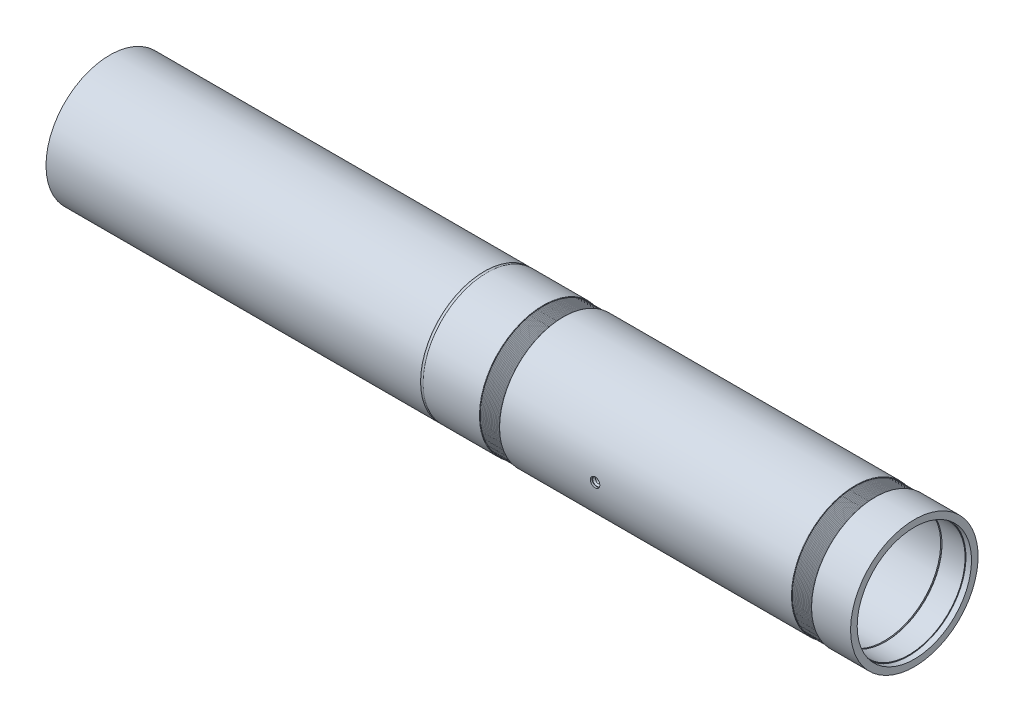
ISO-10303-21;
HEADER;
FILE_DESCRIPTION(('STEP AP214'),'2;1');
FILE_NAME('part.step','',(''),(''),'','','');
FILE_SCHEMA(('AUTOMOTIVE_DESIGN { 1 0 10303 214 1 1 1 1 }'));
ENDSEC;
DATA;
#1=APPLICATION_CONTEXT('core data for automotive mechanical design processes');
#2=APPLICATION_PROTOCOL_DEFINITION('international standard','automotive_design',2000,#1);
#3=PRODUCT_CONTEXT('',#1,'mechanical');
#4=PRODUCT('Part','Part','',(#3));
#5=PRODUCT_RELATED_PRODUCT_CATEGORY('part','',(#4));
#6=PRODUCT_DEFINITION_FORMATION('','',#4);
#7=PRODUCT_DEFINITION_CONTEXT('part definition',#1,'design');
#8=PRODUCT_DEFINITION('design','',#6,#7);
#9=PRODUCT_DEFINITION_SHAPE('','',#8);
#10=(LENGTH_UNIT() NAMED_UNIT(*) SI_UNIT(.MILLI.,.METRE.));
#11=(NAMED_UNIT(*) PLANE_ANGLE_UNIT() SI_UNIT($,.RADIAN.));
#12=(NAMED_UNIT(*) SI_UNIT($,.STERADIAN.) SOLID_ANGLE_UNIT());
#13=UNCERTAINTY_MEASURE_WITH_UNIT(LENGTH_MEASURE(1.E-05),#10,'distance_accuracy_value','');
#14=(GEOMETRIC_REPRESENTATION_CONTEXT(3) GLOBAL_UNCERTAINTY_ASSIGNED_CONTEXT((#13)) GLOBAL_UNIT_ASSIGNED_CONTEXT((#10,
#11,#12)) REPRESENTATION_CONTEXT('',''));
#15=CARTESIAN_POINT('',(0.,0.,0.));
#16=DIRECTION('',(0.,0.,1.));
#17=DIRECTION('',(1.,0.,0.));
#18=AXIS2_PLACEMENT_3D('',#15,#16,#17);
#19=CARTESIAN_POINT('',(0.,0.,0.));
#20=DIRECTION('',(-1.,0.,0.));
#21=DIRECTION('',(0.,0.,1.));
#22=AXIS2_PLACEMENT_3D('',#19,#20,#21);
#23=CYLINDRICAL_SURFACE('',#22,82.5626999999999);
#24=CARTESIAN_POINT('',(964.819,0.,0.));
#25=DIRECTION('',(-1.,0.,0.));
#26=DIRECTION('',(0.,0.,1.));
#27=AXIS2_PLACEMENT_3D('',#24,#25,#26);
#28=CIRCLE('',#27,82.5627);
#29=CARTESIAN_POINT('',(964.819,0.,82.5627));
#30=VERTEX_POINT('',#29);
#31=EDGE_CURVE('E423',#30,#30,#28,.T.);
#32=ORIENTED_EDGE('',*,*,#31,.T.);
#33=EDGE_LOOP('',(#32));
#34=FACE_BOUND('',#33,.T.);
#35=CARTESIAN_POINT('',(587.121,0.,0.));
#36=DIRECTION('',(-1.,0.,0.));
#37=DIRECTION('',(0.,0.,1.));
#38=AXIS2_PLACEMENT_3D('',#35,#36,#37);
#39=CIRCLE('',#38,82.5626999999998);
#40=CARTESIAN_POINT('',(587.121,0.,82.5626999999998));
#41=VERTEX_POINT('',#40);
#42=EDGE_CURVE('E420',#41,#41,#39,.T.);
#43=ORIENTED_EDGE('',*,*,#42,.F.);
#44=EDGE_LOOP('',(#43));
#45=FACE_BOUND('',#44,.T.);
#46=CARTESIAN_POINT('',(716.8515,0.,82.5626999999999));
#47=CARTESIAN_POINT('',(716.851501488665,0.172794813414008,82.5627003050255));
#48=CARTESIAN_POINT('',(716.844225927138,0.345566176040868,82.5621564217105));
#49=CARTESIAN_POINT('',(716.815176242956,0.689934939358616,82.5599967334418));
#50=CARTESIAN_POINT('',(716.793398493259,0.861532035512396,82.5583806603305));
#51=CARTESIAN_POINT('',(716.73547215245,1.20241515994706,82.5541199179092));
#52=CARTESIAN_POINT('',(716.699311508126,1.37169912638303,82.5514743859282));
#53=CARTESIAN_POINT('',(716.612865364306,1.70667016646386,82.5452286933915));
#54=CARTESIAN_POINT('',(716.562574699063,1.87235590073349,82.5416281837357));
#55=CARTESIAN_POINT('',(716.448288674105,2.19873843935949,82.5335786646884));
#56=CARTESIAN_POINT('',(716.384305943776,2.35943968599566,82.5291304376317));
#57=CARTESIAN_POINT('',(716.243040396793,2.67493456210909,82.5195072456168));
#58=CARTESIAN_POINT('',(716.165752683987,2.82972599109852,82.5143320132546));
#59=CARTESIAN_POINT('',(715.998494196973,3.13215611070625,82.5034054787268));
#60=CARTESIAN_POINT('',(715.908530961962,3.27979898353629,82.4976545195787));
#61=CARTESIAN_POINT('',(715.716489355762,3.56704436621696,82.4857339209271));
#62=CARTESIAN_POINT('',(715.614406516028,3.7066438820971,82.479564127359));
#63=CARTESIAN_POINT('',(715.398715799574,3.97695973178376,82.4669725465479));
#64=CARTESIAN_POINT('',(715.285091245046,4.10766274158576,82.4605504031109));
#65=CARTESIAN_POINT('',(715.047201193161,4.35908536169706,82.4476419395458));
#66=CARTESIAN_POINT('',(714.922931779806,4.47980126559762,82.4411555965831));
#67=CARTESIAN_POINT('',(714.664707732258,4.71030535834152,82.4283069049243));
#68=CARTESIAN_POINT('',(714.530756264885,4.82009709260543,82.4219445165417));
#69=CARTESIAN_POINT('',(714.254026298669,5.0280590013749,82.4095195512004));
#70=CARTESIAN_POINT('',(714.111244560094,5.12622487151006,82.4034570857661));
#71=CARTESIAN_POINT('',(713.817789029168,5.31026382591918,82.391802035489));
#72=CARTESIAN_POINT('',(713.667109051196,5.39612707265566,82.3862098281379));
#73=CARTESIAN_POINT('',(713.358976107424,5.55488366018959,82.3756579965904));
#74=CARTESIAN_POINT('',(713.20152065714,5.62777219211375,82.3706986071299));
#75=CARTESIAN_POINT('',(712.881052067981,5.75999209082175,82.3615585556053));
#76=CARTESIAN_POINT('',(712.718041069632,5.81932861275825,82.35737759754));
#77=CARTESIAN_POINT('',(712.387565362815,5.92406981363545,82.3499091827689));
#78=CARTESIAN_POINT('',(712.220099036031,5.9694693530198,82.346622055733));
#79=CARTESIAN_POINT('',(711.713553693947,6.08401626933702,82.3382679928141));
#80=CARTESIAN_POINT('',(711.36936956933,6.13190637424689,82.3346801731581));
#81=CARTESIAN_POINT('',(710.678017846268,6.16921870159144,82.3318921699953));
#82=CARTESIAN_POINT('',(710.330850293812,6.15864182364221,82.3326919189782));
#83=CARTESIAN_POINT('',(709.643891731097,6.07948522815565,82.3385744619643));
#84=CARTESIAN_POINT('',(709.304087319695,6.01102191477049,82.3436486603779));
#85=CARTESIAN_POINT('',(708.640820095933,5.81819628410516,82.3574968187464));
#86=CARTESIAN_POINT('',(708.317357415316,5.69383351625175,82.366270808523));
#87=CARTESIAN_POINT('',(707.695566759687,5.39261341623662,82.3865392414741));
#88=CARTESIAN_POINT('',(707.39726430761,5.21570358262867,82.3980364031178));
#89=CARTESIAN_POINT('',(706.834545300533,4.81444764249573,82.4224531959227));
#90=CARTESIAN_POINT('',(706.57012929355,4.59010076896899,82.4353728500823));
#91=CARTESIAN_POINT('',(706.08201059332,4.0996852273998,82.4612169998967));
#92=CARTESIAN_POINT('',(705.858409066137,3.83351585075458,82.4741414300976));
#93=CARTESIAN_POINT('',(705.459048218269,3.26736288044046,82.4985085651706));
#94=CARTESIAN_POINT('',(705.283288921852,2.96737926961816,82.509951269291));
#95=CARTESIAN_POINT('',(704.984608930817,2.34204951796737,82.530067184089));
#96=CARTESIAN_POINT('',(704.861692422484,2.01670137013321,82.5387401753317));
#97=CARTESIAN_POINT('',(704.672256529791,1.34990688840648,82.5523367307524));
#98=CARTESIAN_POINT('',(704.605736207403,1.00846082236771,82.5572603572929));
#99=CARTESIAN_POINT('',(704.531107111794,0.320040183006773,82.5627953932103));
#100=CARTESIAN_POINT('',(704.52285853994,-0.0269191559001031,82.5634171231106));
#101=CARTESIAN_POINT('',(704.564641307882,-0.717288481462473,82.5603058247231));
#102=CARTESIAN_POINT('',(704.614672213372,-1.06069849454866,82.5565728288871));
#103=CARTESIAN_POINT('',(704.771477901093,-1.73382459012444,82.5451787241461));
#104=CARTESIAN_POINT('',(704.878188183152,-2.06355577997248,82.5375220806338));
#105=CARTESIAN_POINT('',(705.145257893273,-2.70043157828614,82.5191413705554));
#106=CARTESIAN_POINT('',(705.305618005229,-3.00757589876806,82.5084172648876));
#107=CARTESIAN_POINT('',(705.675788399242,-3.59119731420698,82.4850793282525));
#108=CARTESIAN_POINT('',(705.885691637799,-3.86761530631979,82.4724619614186));
#109=CARTESIAN_POINT('',(706.348856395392,-4.38134157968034,82.4467680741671));
#110=CARTESIAN_POINT('',(706.602118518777,-4.61864931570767,82.4336915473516));
#111=CARTESIAN_POINT('',(707.145412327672,-5.04789610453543,82.4085227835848));
#112=CARTESIAN_POINT('',(707.4355159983,-5.23974417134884,82.3964325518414));
#113=CARTESIAN_POINT('',(708.043915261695,-5.5720007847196,82.3746325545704));
#114=CARTESIAN_POINT('',(708.362210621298,-5.71240975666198,82.3649227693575));
#115=CARTESIAN_POINT('',(709.01756692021,-5.93765305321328,82.3489921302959));
#116=CARTESIAN_POINT('',(709.35460843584,-6.02254378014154,82.3427677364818));
#117=CARTESIAN_POINT('',(710.038397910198,-6.1344996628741,82.3345045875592));
#118=CARTESIAN_POINT('',(710.385145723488,-6.16156568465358,82.332465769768));
#119=CARTESIAN_POINT('',(710.904213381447,-6.15828012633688,82.3327081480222));
#120=CARTESIAN_POINT('',(711.076942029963,-6.14989162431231,82.3333374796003));
#121=CARTESIAN_POINT('',(711.4210597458,-6.11863563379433,82.3356667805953));
#122=CARTESIAN_POINT('',(711.592449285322,-6.0957735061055,82.3373663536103));
#123=CARTESIAN_POINT('',(711.932737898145,-6.03571768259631,82.3417903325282));
#124=CARTESIAN_POINT('',(712.101636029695,-5.99851870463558,82.3445151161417));
#125=CARTESIAN_POINT('',(712.435632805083,-5.91007721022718,82.3509100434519));
#126=CARTESIAN_POINT('',(712.600732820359,-5.85883985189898,82.354579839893));
#127=CARTESIAN_POINT('',(712.926078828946,-5.74266318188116,82.3627624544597));
#128=CARTESIAN_POINT('',(713.086323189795,-5.67771931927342,82.3672755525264));
#129=CARTESIAN_POINT('',(713.40071186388,-5.53463075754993,82.3770139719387));
#130=CARTESIAN_POINT('',(713.554858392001,-5.45649090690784,82.3822390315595));
#131=CARTESIAN_POINT('',(713.856079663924,-5.28752038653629,82.3932565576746));
#132=CARTESIAN_POINT('',(714.003151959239,-5.19668536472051,82.3990492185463));
#133=CARTESIAN_POINT('',(714.289081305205,-5.00302414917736,82.4110343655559));
#134=CARTESIAN_POINT('',(714.427941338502,-4.90020234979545,82.4172267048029));
#135=CARTESIAN_POINT('',(714.696891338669,-4.68297409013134,82.4298553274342));
#136=CARTESIAN_POINT('',(714.826956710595,-4.56853721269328,82.4362922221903));
#137=CARTESIAN_POINT('',(715.076942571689,-4.32916345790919,82.4492094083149));
#138=CARTESIAN_POINT('',(715.196866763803,-4.20423044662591,82.4556896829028));
#139=CARTESIAN_POINT('',(715.425847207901,-3.94462991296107,82.4685165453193));
#140=CARTESIAN_POINT('',(715.534896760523,-3.80995647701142,82.4748630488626));
#141=CARTESIAN_POINT('',(715.741233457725,-3.53194523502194,82.4872362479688));
#142=CARTESIAN_POINT('',(715.838524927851,-3.38861064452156,82.4932630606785));
#143=CARTESIAN_POINT('',(716.02087880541,-3.09395657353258,82.5048401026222));
#144=CARTESIAN_POINT('',(716.105917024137,-2.942622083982,82.5103893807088));
#145=CARTESIAN_POINT('',(716.262900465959,-2.63335726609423,82.5208385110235));
#146=CARTESIAN_POINT('',(716.334850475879,-2.4754293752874,82.5257386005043));
#147=CARTESIAN_POINT('',(716.465123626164,-2.15418144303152,82.5347485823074));
#148=CARTESIAN_POINT('',(716.523458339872,-1.99086611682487,82.5388591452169));
#149=CARTESIAN_POINT('',(716.626144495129,-1.65993529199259,82.5461776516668));
#150=CARTESIAN_POINT('',(716.67049947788,-1.49232089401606,82.5493858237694));
#151=CARTESIAN_POINT('',(716.755445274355,-1.10608496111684,82.5555755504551));
#152=CARTESIAN_POINT('',(716.791433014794,-0.88643042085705,82.5582370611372));
#153=CARTESIAN_POINT('',(716.839459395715,-0.444504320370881,82.5617990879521));
#154=CARTESIAN_POINT('',(716.851498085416,-0.222232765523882,82.5626996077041));
#155=CARTESIAN_POINT('',(716.8515,0.,82.5626999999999));
#156=B_SPLINE_CURVE_WITH_KNOTS('',3,(#46,#47,#48,#49,#50,#51,#52,#53,#54,#55,#56,#57,#58,#59,
#60,#61,#62,#63,#64,#65,#66,#67,#68,#69,#70,#71,#72,#73,#74,#75,#76,#77,#78,#79,#80,#81,#82,#83,
#84,#85,#86,#87,#88,#89,#90,#91,#92,#93,#94,#95,#96,#97,#98,#99,#100,#101,#102,#103,#104,#105,
#106,#107,#108,#109,#110,#111,#112,#113,#114,#115,#116,#117,#118,#119,#120,#121,#122,#123,#124,
#125,#126,#127,#128,#129,#130,#131,#132,#133,#134,#135,#136,#137,#138,#139,#140,#141,#142,#143,
#144,#145,#146,#147,#148,#149,#150,#151,#152,#153,#154,#155),.UNSPECIFIED.,.T.,.F.,(4,2,2,2,2,2,
2,2,2,2,2,2,2,2,2,2,2,2,2,2,2,2,2,2,2,2,2,2,2,2,2,2,2,2,2,2,2,2,2,2,2,2,2,2,2,2,2,2,2,2,2,2,2,2,
4),(0.,0.518190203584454,1.03651005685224,1.55526519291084,2.07421022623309,2.59267863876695,
3.11133825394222,3.62969067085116,4.14823480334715,4.66753919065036,5.18703544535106,
5.70636254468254,6.22588132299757,6.74581323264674,7.26593744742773,7.78586347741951,
8.30598101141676,9.34314419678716,10.3802914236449,11.4153579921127,12.4504329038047,
13.4865454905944,14.5226748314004,15.5613385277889,16.6000027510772,17.6387492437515,
18.677478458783,19.7137148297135,20.7499434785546,21.7849954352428,22.8200605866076,
23.8570834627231,24.8941207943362,25.9332165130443,26.9723036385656,28.0103334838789,
29.048347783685,29.5666437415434,30.0847478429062,30.6030430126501,31.1211480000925,
31.6394252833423,32.1575125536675,32.675777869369,33.1938537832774,33.7133232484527,
34.2326022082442,34.7521991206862,35.2716042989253,35.7920211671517,36.3122473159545,
36.8320296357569,37.3516801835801,38.018130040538,38.6845785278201),.UNSPECIFIED.);
#157=CARTESIAN_POINT('',(716.8515,0.,82.5626999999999));
#158=VERTEX_POINT('',#157);
#159=EDGE_CURVE('E10',#158,#158,#156,.T.);
#160=ORIENTED_EDGE('',*,*,#159,.F.);
#161=EDGE_LOOP('',(#160));
#162=FACE_BOUND('',#161,.T.);
#163=ADVANCED_FACE('F26',(#34,#45,#162),#23,.T.);
#164=CARTESIAN_POINT('',(0.,0.,0.));
#165=DIRECTION('',(-1.,0.,0.));
#166=DIRECTION('',(0.,0.,1.));
#167=AXIS2_PLACEMENT_3D('',#164,#165,#166);
#168=CYLINDRICAL_SURFACE('',#167,73.0376999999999);
#169=CARTESIAN_POINT('',(753.0973,0.,0.));
#170=DIRECTION('',(-1.,0.,0.));
#171=DIRECTION('',(0.,0.,1.));
#172=AXIS2_PLACEMENT_3D('',#169,#170,#171);
#173=CIRCLE('',#172,73.0376999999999);
#174=CARTESIAN_POINT('',(753.0973,0.,73.0376999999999));
#175=VERTEX_POINT('',#174);
#176=EDGE_CURVE('E569',#175,#175,#173,.T.);
#177=ORIENTED_EDGE('',*,*,#176,.F.);
#178=EDGE_LOOP('',(#177));
#179=FACE_BOUND('',#178,.T.);
#180=CARTESIAN_POINT('',(288.3154,0.,0.));
#181=DIRECTION('',(-1.,0.,0.));
#182=DIRECTION('',(0.,0.,1.));
#183=AXIS2_PLACEMENT_3D('',#180,#181,#182);
#184=CIRCLE('',#183,73.0376999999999);
#185=CARTESIAN_POINT('',(288.3154,0.,73.0376999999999));
#186=VERTEX_POINT('',#185);
#187=EDGE_CURVE('E572',#186,#186,#184,.T.);
#188=ORIENTED_EDGE('',*,*,#187,.T.);
#189=EDGE_LOOP('',(#188));
#190=FACE_BOUND('',#189,.T.);
#191=CARTESIAN_POINT('',(714.1464,0.,73.0376999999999));
#192=CARTESIAN_POINT('',(714.146391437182,-0.193918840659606,73.0376989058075));
#193=CARTESIAN_POINT('',(714.130016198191,-0.387975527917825,73.0369194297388));
#194=CARTESIAN_POINT('',(714.064923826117,-0.770736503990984,73.0338848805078));
#195=CARTESIAN_POINT('',(714.01616850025,-0.959434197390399,73.031628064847));
#196=CARTESIAN_POINT('',(713.887714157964,-1.32587707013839,73.0258942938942));
#197=CARTESIAN_POINT('',(713.808030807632,-1.50362774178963,73.0224179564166));
#198=CARTESIAN_POINT('',(713.620006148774,-1.84318188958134,73.014636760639));
#199=CARTESIAN_POINT('',(713.511671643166,-2.00498913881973,73.0103320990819));
#200=CARTESIAN_POINT('',(713.269308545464,-2.30826048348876,73.0013741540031));
#201=CARTESIAN_POINT('',(713.135259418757,-2.44970816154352,72.996720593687));
#202=CARTESIAN_POINT('',(712.845312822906,-2.70810543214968,72.9875917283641));
#203=CARTESIAN_POINT('',(712.689414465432,-2.82505402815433,72.9831164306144));
#204=CARTESIAN_POINT('',(712.360110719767,-3.03117706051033,72.9748468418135));
#205=CARTESIAN_POINT('',(712.186697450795,-3.12033891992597,72.9710528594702));
#206=CARTESIAN_POINT('',(711.827341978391,-3.26827673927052,72.9645770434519));
#207=CARTESIAN_POINT('',(711.641399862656,-3.32705291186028,72.9618952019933));
#208=CARTESIAN_POINT('',(711.262413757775,-3.41250820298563,72.9579485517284));
#209=CARTESIAN_POINT('',(711.069375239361,-3.43921153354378,72.9566826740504));
#210=CARTESIAN_POINT('',(710.681551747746,-3.45983782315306,72.9557074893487));
#211=CARTESIAN_POINT('',(710.486766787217,-3.45376101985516,72.9559981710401));
#212=CARTESIAN_POINT('',(710.101144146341,-3.40901973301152,72.9581023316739));
#213=CARTESIAN_POINT('',(709.910303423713,-3.37038140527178,72.9599145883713));
#214=CARTESIAN_POINT('',(709.537819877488,-3.26165439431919,72.9648557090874));
#215=CARTESIAN_POINT('',(709.356177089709,-3.19156558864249,72.9679845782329));
#216=CARTESIAN_POINT('',(709.007161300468,-3.02189728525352,72.9752076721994));
#217=CARTESIAN_POINT('',(708.839794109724,-2.92230585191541,72.9793022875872));
#218=CARTESIAN_POINT('',(708.524144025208,-2.69646803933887,72.9879949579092));
#219=CARTESIAN_POINT('',(708.375861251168,-2.57022149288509,72.9925930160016));
#220=CARTESIAN_POINT('',(708.102436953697,-2.29450947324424,73.0017797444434));
#221=CARTESIAN_POINT('',(707.977318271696,-2.14502134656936,73.0063684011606));
#222=CARTESIAN_POINT('',(707.753949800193,-1.82714924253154,73.015014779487));
#223=CARTESIAN_POINT('',(707.655700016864,-1.65876526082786,73.0190725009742));
#224=CARTESIAN_POINT('',(707.488860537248,-1.30786798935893,73.0261998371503));
#225=CARTESIAN_POINT('',(707.420271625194,-1.12535432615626,73.0292694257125));
#226=CARTESIAN_POINT('',(707.314715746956,-0.751384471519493,73.0340741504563));
#227=CARTESIAN_POINT('',(707.277748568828,-0.55992834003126,73.035809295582));
#228=CARTESIAN_POINT('',(707.236513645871,-0.173706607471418,73.0377484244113));
#229=CARTESIAN_POINT('',(707.232214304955,0.021055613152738,73.0379538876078));
#230=CARTESIAN_POINT('',(707.25635466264,0.408535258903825,73.0368144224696));
#231=CARTESIAN_POINT('',(707.284794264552,0.601252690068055,73.0354694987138));
#232=CARTESIAN_POINT('',(707.373579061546,0.979083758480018,73.0313817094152));
#233=CARTESIAN_POINT('',(707.433909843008,1.16420079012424,73.0286394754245));
#234=CARTESIAN_POINT('',(707.584749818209,1.52168078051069,73.0220658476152));
#235=CARTESIAN_POINT('',(707.675259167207,1.69404367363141,73.0182344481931));
#236=CARTESIAN_POINT('',(707.883968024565,2.0212677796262,73.0099099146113));
#237=CARTESIAN_POINT('',(708.002188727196,2.17611546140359,73.0054162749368));
#238=CARTESIAN_POINT('',(708.262933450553,2.46377756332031,72.9962750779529));
#239=CARTESIAN_POINT('',(708.405457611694,2.5965918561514,72.9916275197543));
#240=CARTESIAN_POINT('',(708.710899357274,2.83652331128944,72.9826981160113));
#241=CARTESIAN_POINT('',(708.873833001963,2.94362004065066,72.9784165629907));
#242=CARTESIAN_POINT('',(709.215387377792,3.1289366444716,72.9707065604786));
#243=CARTESIAN_POINT('',(709.394008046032,3.20715663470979,72.9672781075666));
#244=CARTESIAN_POINT('',(709.761790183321,3.33246371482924,72.9616629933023));
#245=CARTESIAN_POINT('',(709.950947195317,3.37956386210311,72.9594758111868));
#246=CARTESIAN_POINT('',(710.334495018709,3.44133697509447,72.9565884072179));
#247=CARTESIAN_POINT('',(710.528885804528,3.45601009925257,72.955888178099));
#248=CARTESIAN_POINT('',(710.917179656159,3.45251111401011,72.9560538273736));
#249=CARTESIAN_POINT('',(711.111083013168,3.43437115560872,72.9569181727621));
#250=CARTESIAN_POINT('',(711.49308817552,3.3658273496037,72.9601123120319));
#251=CARTESIAN_POINT('',(711.68118996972,3.31542344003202,72.9624421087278));
#252=CARTESIAN_POINT('',(712.046259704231,3.18378890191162,72.9683042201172));
#253=CARTESIAN_POINT('',(712.223227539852,3.10255798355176,72.9718365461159));
#254=CARTESIAN_POINT('',(712.561014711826,2.91158119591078,72.9797054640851));
#255=CARTESIAN_POINT('',(712.721834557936,2.80183622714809,72.9840420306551));
#256=CARTESIAN_POINT('',(713.022920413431,2.55683278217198,72.9930354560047));
#257=CARTESIAN_POINT('',(713.163168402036,2.42155217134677,72.9976925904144));
#258=CARTESIAN_POINT('',(713.419006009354,2.12932688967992,73.006800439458));
#259=CARTESIAN_POINT('',(713.534589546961,1.97237689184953,73.0112511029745));
#260=CARTESIAN_POINT('',(713.73786558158,1.64115513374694,73.0194472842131));
#261=CARTESIAN_POINT('',(713.825532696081,1.46686779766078,73.023192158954));
#262=CARTESIAN_POINT('',(713.970256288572,1.10616146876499,73.0295449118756));
#263=CARTESIAN_POINT('',(714.027348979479,0.919757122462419,73.0321541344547));
#264=CARTESIAN_POINT('',(714.094302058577,0.610159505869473,73.0352502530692));
#265=CARTESIAN_POINT('',(714.113813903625,0.48897227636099,73.0361648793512));
#266=CARTESIAN_POINT('',(714.139865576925,0.245208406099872,73.0373900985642));
#267=CARTESIAN_POINT('',(714.146405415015,0.122631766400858,73.0377006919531));
#268=CARTESIAN_POINT('',(714.1464,0.,73.0376999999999));
#269=B_SPLINE_CURVE_WITH_KNOTS('',3,(#191,#192,#193,#194,#195,#196,#197,#198,#199,#200,#201,
#202,#203,#204,#205,#206,#207,#208,#209,#210,#211,#212,#213,#214,#215,#216,#217,#218,#219,#220,
#221,#222,#223,#224,#225,#226,#227,#228,#229,#230,#231,#232,#233,#234,#235,#236,#237,#238,#239,
#240,#241,#242,#243,#244,#245,#246,#247,#248,#249,#250,#251,#252,#253,#254,#255,#256,#257,#258,
#259,#260,#261,#262,#263,#264,#265,#266,#267,#268),.UNSPECIFIED.,.T.,.F.,(4,2,2,2,2,2,2,2,2,2,2,
2,2,2,2,2,2,2,2,2,2,2,2,2,2,2,2,2,2,2,2,2,2,2,2,2,2,2,4),(0.,0.581308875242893,1.16330463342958,
1.74500597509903,2.32656932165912,2.90859902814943,3.49065240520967,4.07296885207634,
4.65528122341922,5.23715372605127,5.81902201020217,6.40042334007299,6.98182693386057,
7.56346606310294,8.14510884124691,8.72732214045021,9.30953557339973,9.89176439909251,
10.4739893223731,11.0556510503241,11.6373110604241,12.2187084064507,12.8001087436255,
13.381955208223,13.9638050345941,14.5461156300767,15.1284238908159,15.7104876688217,
16.2925486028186,16.8740395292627,17.4555315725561,18.0370290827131,18.6185082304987,
19.2004937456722,19.7826225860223,20.3652792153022,20.9472442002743,21.3148566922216,
21.6824689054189),.UNSPECIFIED.);
#270=CARTESIAN_POINT('',(714.1464,0.,73.0376999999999));
#271=VERTEX_POINT('',#270);
#272=EDGE_CURVE('E37',#271,#271,#269,.T.);
#273=ORIENTED_EDGE('',*,*,#272,.F.);
#274=EDGE_LOOP('',(#273));
#275=FACE_BOUND('',#274,.T.);
#276=ADVANCED_FACE('F52',(#179,#190,#275),#168,.F.);
#277=CARTESIAN_POINT('',(7.11200000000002,0.,0.));
#278=DIRECTION('',(-1.,0.,0.));
#279=DIRECTION('',(0.,0.,1.));
#280=AXIS2_PLACEMENT_3D('',#277,#278,#279);
#281=TOROIDAL_SURFACE('',#280,73.7235,0.254000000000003);
#282=CARTESIAN_POINT('',(7.36600000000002,0.,0.));
#283=DIRECTION('',(-1.,0.,0.));
#284=DIRECTION('',(0.,0.,1.));
#285=AXIS2_PLACEMENT_3D('',#282,#283,#284);
#286=CIRCLE('',#285,73.7235);
#287=CARTESIAN_POINT('',(7.36600000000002,0.,73.7235));
#288=VERTEX_POINT('',#287);
#289=EDGE_CURVE('E602',#288,#288,#286,.T.);
#290=ORIENTED_EDGE('',*,*,#289,.F.);
#291=EDGE_LOOP('',(#290));
#292=FACE_BOUND('',#291,.T.);
#293=CARTESIAN_POINT('',(7.11200000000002,0.,0.));
#294=DIRECTION('',(-1.,0.,0.));
#295=DIRECTION('',(0.,0.,1.));
#296=AXIS2_PLACEMENT_3D('',#293,#294,#295);
#297=CIRCLE('',#296,73.9775);
#298=CARTESIAN_POINT('',(7.11200000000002,0.,73.9775));
#299=VERTEX_POINT('',#298);
#300=EDGE_CURVE('E41',#299,#299,#297,.T.);
#301=ORIENTED_EDGE('',*,*,#300,.T.);
#302=EDGE_LOOP('',(#301));
#303=FACE_BOUND('',#302,.T.);
#304=ADVANCED_FACE('F28',(#292,#303),#281,.F.);
#305=CARTESIAN_POINT('',(0.,0.,0.));
#306=DIRECTION('',(-1.,0.,0.));
#307=DIRECTION('',(0.,0.,1.));
#308=AXIS2_PLACEMENT_3D('',#305,#306,#307);
#309=CYLINDRICAL_SURFACE('',#308,73.9775);
#310=ORIENTED_EDGE('',*,*,#300,.F.);
#311=EDGE_LOOP('',(#310));
#312=FACE_BOUND('',#311,.T.);
#313=CARTESIAN_POINT('',(0.,0.,0.));
#314=DIRECTION('',(-1.,0.,0.));
#315=DIRECTION('',(0.,0.,1.));
#316=AXIS2_PLACEMENT_3D('',#313,#314,#315);
#317=CIRCLE('',#316,73.9775);
#318=CARTESIAN_POINT('',(0.,0.,73.9775));
#319=VERTEX_POINT('',#318);
#320=EDGE_CURVE('E45',#319,#319,#317,.T.);
#321=ORIENTED_EDGE('',*,*,#320,.T.);
#322=EDGE_LOOP('',(#321));
#323=FACE_BOUND('',#322,.T.);
#324=ADVANCED_FACE('F290',(#312,#323),#309,.F.);
#325=CARTESIAN_POINT('',(0.,82.5626999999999,0.));
#326=DIRECTION('',(1.,0.,0.));
#327=DIRECTION('',(0.,0.,-1.));
#328=AXIS2_PLACEMENT_3D('',#325,#326,#327);
#329=PLANE('',#328);
#330=ORIENTED_EDGE('',*,*,#320,.F.);
#331=EDGE_LOOP('',(#330));
#332=FACE_BOUND('',#331,.T.);
#333=CARTESIAN_POINT('',(0.,0.,0.));
#334=DIRECTION('',(-1.,0.,0.));
#335=DIRECTION('',(0.,0.,1.));
#336=AXIS2_PLACEMENT_3D('',#333,#334,#335);
#337=CIRCLE('',#336,82.5626999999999);
#338=CARTESIAN_POINT('',(0.,0.,82.5626999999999));
#339=VERTEX_POINT('',#338);
#340=EDGE_CURVE('E302',#339,#339,#337,.T.);
#341=ORIENTED_EDGE('',*,*,#340,.T.);
#342=EDGE_LOOP('',(#341));
#343=FACE_BOUND('',#342,.T.);
#344=ADVANCED_FACE('F287',(#332,#343),#329,.F.);
#345=CARTESIAN_POINT('',(0.,0.,0.));
#346=DIRECTION('',(-1.,0.,0.));
#347=DIRECTION('',(0.,0.,1.));
#348=AXIS2_PLACEMENT_3D('',#345,#346,#347);
#349=CYLINDRICAL_SURFACE('',#348,82.5626999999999);
#350=ORIENTED_EDGE('',*,*,#340,.F.);
#351=EDGE_LOOP('',(#350));
#352=FACE_BOUND('',#351,.T.);
#353=CARTESIAN_POINT('',(484.819708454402,0.,0.));
#354=DIRECTION('',(-1.,0.,0.));
#355=DIRECTION('',(0.,0.,1.));
#356=AXIS2_PLACEMENT_3D('',#353,#354,#355);
#357=CIRCLE('',#356,82.5626999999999);
#358=CARTESIAN_POINT('',(484.819708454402,0.,82.5626999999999));
#359=VERTEX_POINT('',#358);
#360=EDGE_CURVE('E304',#359,#359,#357,.T.);
#361=ORIENTED_EDGE('',*,*,#360,.T.);
#362=EDGE_LOOP('',(#361));
#363=FACE_BOUND('',#362,.T.);
#364=ADVANCED_FACE('F283',(#352,#363),#349,.T.);
#365=CARTESIAN_POINT('',(486.41,0.,0.));
#366=DIRECTION('',(-1.,0.,0.));
#367=DIRECTION('',(0.,0.,1.));
#368=AXIS2_PLACEMENT_3D('',#365,#366,#367);
#369=TOROIDAL_SURFACE('',#368,83.2992999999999,1.75260000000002);
#370=ORIENTED_EDGE('',*,*,#360,.F.);
#371=EDGE_LOOP('',(#370));
#372=FACE_BOUND('',#371,.T.);
#373=CARTESIAN_POINT('',(488.000291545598,0.,0.));
#374=DIRECTION('',(-1.,0.,0.));
#375=DIRECTION('',(0.,0.,1.));
#376=AXIS2_PLACEMENT_3D('',#373,#374,#375);
#377=CIRCLE('',#376,82.5626999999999);
#378=CARTESIAN_POINT('',(488.000291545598,0.,82.5626999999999));
#379=VERTEX_POINT('',#378);
#380=EDGE_CURVE('E309',#379,#379,#377,.T.);
#381=ORIENTED_EDGE('',*,*,#380,.T.);
#382=EDGE_LOOP('',(#381));
#383=FACE_BOUND('',#382,.T.);
#384=ADVANCED_FACE('F279',(#372,#383),#369,.F.);
#385=CARTESIAN_POINT('',(0.,0.,0.));
#386=DIRECTION('',(-1.,0.,0.));
#387=DIRECTION('',(0.,0.,1.));
#388=AXIS2_PLACEMENT_3D('',#385,#386,#387);
#389=CYLINDRICAL_SURFACE('',#388,82.5626999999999);
#390=ORIENTED_EDGE('',*,*,#380,.F.);
#391=EDGE_LOOP('',(#390));
#392=FACE_BOUND('',#391,.T.);
#393=CARTESIAN_POINT('',(560.959,0.,0.));
#394=DIRECTION('',(-1.,0.,0.));
#395=DIRECTION('',(0.,0.,1.));
#396=AXIS2_PLACEMENT_3D('',#393,#394,#395);
#397=CIRCLE('',#396,82.5626999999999);
#398=CARTESIAN_POINT('',(560.959,0.,82.5626999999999));
#399=VERTEX_POINT('',#398);
#400=EDGE_CURVE('E312',#399,#399,#397,.T.);
#401=ORIENTED_EDGE('',*,*,#400,.T.);
#402=EDGE_LOOP('',(#401));
#403=FACE_BOUND('',#402,.T.);
#404=ADVANCED_FACE('F275',(#392,#403),#389,.T.);
#405=CARTESIAN_POINT('',(560.959,0.,0.));
#406=DIRECTION('',(-1.,0.,0.));
#407=DIRECTION('',(0.,0.,1.));
#408=AXIS2_PLACEMENT_3D('',#405,#406,#407);
#409=TOROIDAL_SURFACE('',#408,82.1817,0.381000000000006);
#410=ORIENTED_EDGE('',*,*,#400,.F.);
#411=EDGE_LOOP('',(#410));
#412=FACE_BOUND('',#411,.T.);
#413=CARTESIAN_POINT('',(561.34,0.,0.));
#414=DIRECTION('',(-1.,0.,0.));
#415=DIRECTION('',(0.,0.,1.));
#416=AXIS2_PLACEMENT_3D('',#413,#414,#415);
#417=CIRCLE('',#416,82.1817);
#418=CARTESIAN_POINT('',(561.34,0.,82.1817));
#419=VERTEX_POINT('',#418);
#420=EDGE_CURVE('E315',#419,#419,#417,.T.);
#421=ORIENTED_EDGE('',*,*,#420,.T.);
#422=EDGE_LOOP('',(#421));
#423=FACE_BOUND('',#422,.T.);
#424=ADVANCED_FACE('F271',(#412,#423),#409,.T.);
#425=CARTESIAN_POINT('',(561.34,82.1817,0.));
#426=DIRECTION('',(-1.,0.,0.));
#427=DIRECTION('',(0.,0.,1.));
#428=AXIS2_PLACEMENT_3D('',#425,#426,#427);
#429=PLANE('',#428);
#430=ORIENTED_EDGE('',*,*,#420,.F.);
#431=EDGE_LOOP('',(#430));
#432=FACE_BOUND('',#431,.T.);
#433=CARTESIAN_POINT('',(561.34,0.,0.));
#434=DIRECTION('',(-1.,0.,0.));
#435=DIRECTION('',(0.,0.,1.));
#436=AXIS2_PLACEMENT_3D('',#433,#434,#435);
#437=CIRCLE('',#436,81.8007);
#438=CARTESIAN_POINT('',(561.34,0.,81.8007));
#439=VERTEX_POINT('',#438);
#440=EDGE_CURVE('E318',#439,#439,#437,.T.);
#441=ORIENTED_EDGE('',*,*,#440,.T.);
#442=EDGE_LOOP('',(#441));
#443=FACE_BOUND('',#442,.T.);
#444=ADVANCED_FACE('F267',(#432,#443),#429,.F.);
#445=CARTESIAN_POINT('',(562.13375,0.,0.));
#446=DIRECTION('',(-1.,0.,0.));
#447=DIRECTION('',(0.,0.,1.));
#448=AXIS2_PLACEMENT_3D('',#445,#446,#447);
#449=CONICAL_SURFACE('',#448,80.4258846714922,1.04719755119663);
#450=ORIENTED_EDGE('',*,*,#440,.F.);
#451=EDGE_LOOP('',(#450));
#452=FACE_BOUND('',#451,.T.);
#453=CARTESIAN_POINT('',(562.13375,0.,0.));
#454=DIRECTION('',(-1.,0.,0.));
#455=DIRECTION('',(0.,0.,1.));
#456=AXIS2_PLACEMENT_3D('',#453,#454,#455);
#457=CIRCLE('',#456,80.4258846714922);
#458=CARTESIAN_POINT('',(562.13375,0.,80.4258846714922));
#459=VERTEX_POINT('',#458);
#460=EDGE_CURVE('E321',#459,#459,#457,.T.);
#461=ORIENTED_EDGE('',*,*,#460,.T.);
#462=EDGE_LOOP('',(#461));
#463=FACE_BOUND('',#462,.T.);
#464=ADVANCED_FACE('F263',(#452,#463),#449,.T.);
#465=CARTESIAN_POINT('',(562.9275,0.,0.));
#466=DIRECTION('',(1.,0.,0.));
#467=DIRECTION('',(0.,0.,-1.));
#468=AXIS2_PLACEMENT_3D('',#465,#466,#467);
#469=CONICAL_SURFACE('',#468,81.8007,1.04719755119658);
#470=ORIENTED_EDGE('',*,*,#460,.F.);
#471=EDGE_LOOP('',(#470));
#472=FACE_BOUND('',#471,.T.);
#473=CARTESIAN_POINT('',(562.9275,0.,0.));
#474=DIRECTION('',(-1.,0.,0.));
#475=DIRECTION('',(0.,0.,1.));
#476=AXIS2_PLACEMENT_3D('',#473,#474,#475);
#477=CIRCLE('',#476,81.8007);
#478=CARTESIAN_POINT('',(562.9275,0.,81.8007));
#479=VERTEX_POINT('',#478);
#480=EDGE_CURVE('E324',#479,#479,#477,.T.);
#481=ORIENTED_EDGE('',*,*,#480,.T.);
#482=EDGE_LOOP('',(#481));
#483=FACE_BOUND('',#482,.T.);
#484=ADVANCED_FACE('F259',(#472,#483),#469,.T.);
#485=CARTESIAN_POINT('',(563.72125,0.,0.));
#486=DIRECTION('',(-1.,0.,0.));
#487=DIRECTION('',(0.,0.,1.));
#488=AXIS2_PLACEMENT_3D('',#485,#486,#487);
#489=CONICAL_SURFACE('',#488,80.4258846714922,1.04719755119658);
#490=ORIENTED_EDGE('',*,*,#480,.F.);
#491=EDGE_LOOP('',(#490));
#492=FACE_BOUND('',#491,.T.);
#493=CARTESIAN_POINT('',(563.72125,0.,0.));
#494=DIRECTION('',(-1.,0.,0.));
#495=DIRECTION('',(0.,0.,1.));
#496=AXIS2_PLACEMENT_3D('',#493,#494,#495);
#497=CIRCLE('',#496,80.4258846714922);
#498=CARTESIAN_POINT('',(563.72125,0.,80.4258846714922));
#499=VERTEX_POINT('',#498);
#500=EDGE_CURVE('E327',#499,#499,#497,.T.);
#501=ORIENTED_EDGE('',*,*,#500,.T.);
#502=EDGE_LOOP('',(#501));
#503=FACE_BOUND('',#502,.T.);
#504=ADVANCED_FACE('F255',(#492,#503),#489,.T.);
#505=CARTESIAN_POINT('',(564.515,0.,0.));
#506=DIRECTION('',(1.,0.,0.));
#507=DIRECTION('',(0.,0.,-1.));
#508=AXIS2_PLACEMENT_3D('',#505,#506,#507);
#509=CONICAL_SURFACE('',#508,81.8007,1.04719755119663);
#510=ORIENTED_EDGE('',*,*,#500,.F.);
#511=EDGE_LOOP('',(#510));
#512=FACE_BOUND('',#511,.T.);
#513=CARTESIAN_POINT('',(564.515,0.,0.));
#514=DIRECTION('',(-1.,0.,0.));
#515=DIRECTION('',(0.,0.,1.));
#516=AXIS2_PLACEMENT_3D('',#513,#514,#515);
#517=CIRCLE('',#516,81.8007);
#518=CARTESIAN_POINT('',(564.515,0.,81.8007));
#519=VERTEX_POINT('',#518);
#520=EDGE_CURVE('E330',#519,#519,#517,.T.);
#521=ORIENTED_EDGE('',*,*,#520,.T.);
#522=EDGE_LOOP('',(#521));
#523=FACE_BOUND('',#522,.T.);
#524=ADVANCED_FACE('F251',(#512,#523),#509,.T.);
#525=CARTESIAN_POINT('',(565.30875,0.,0.));
#526=DIRECTION('',(-1.,0.,0.));
#527=DIRECTION('',(0.,0.,1.));
#528=AXIS2_PLACEMENT_3D('',#525,#526,#527);
#529=CONICAL_SURFACE('',#528,80.4258846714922,1.04719755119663);
#530=ORIENTED_EDGE('',*,*,#520,.F.);
#531=EDGE_LOOP('',(#530));
#532=FACE_BOUND('',#531,.T.);
#533=CARTESIAN_POINT('',(565.30875,0.,0.));
#534=DIRECTION('',(-1.,0.,0.));
#535=DIRECTION('',(0.,0.,1.));
#536=AXIS2_PLACEMENT_3D('',#533,#534,#535);
#537=CIRCLE('',#536,80.4258846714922);
#538=CARTESIAN_POINT('',(565.30875,0.,80.4258846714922));
#539=VERTEX_POINT('',#538);
#540=EDGE_CURVE('E333',#539,#539,#537,.T.);
#541=ORIENTED_EDGE('',*,*,#540,.T.);
#542=EDGE_LOOP('',(#541));
#543=FACE_BOUND('',#542,.T.);
#544=ADVANCED_FACE('F247',(#532,#543),#529,.T.);
#545=CARTESIAN_POINT('',(566.1025,0.,0.));
#546=DIRECTION('',(1.,0.,0.));
#547=DIRECTION('',(0.,0.,-1.));
#548=AXIS2_PLACEMENT_3D('',#545,#546,#547);
#549=CONICAL_SURFACE('',#548,81.8007,1.04719755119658);
#550=ORIENTED_EDGE('',*,*,#540,.F.);
#551=EDGE_LOOP('',(#550));
#552=FACE_BOUND('',#551,.T.);
#553=CARTESIAN_POINT('',(566.1025,0.,0.));
#554=DIRECTION('',(-1.,0.,0.));
#555=DIRECTION('',(0.,0.,1.));
#556=AXIS2_PLACEMENT_3D('',#553,#554,#555);
#557=CIRCLE('',#556,81.8007);
#558=CARTESIAN_POINT('',(566.1025,0.,81.8007));
#559=VERTEX_POINT('',#558);
#560=EDGE_CURVE('E336',#559,#559,#557,.T.);
#561=ORIENTED_EDGE('',*,*,#560,.T.);
#562=EDGE_LOOP('',(#561));
#563=FACE_BOUND('',#562,.T.);
#564=ADVANCED_FACE('F243',(#552,#563),#549,.T.);
#565=CARTESIAN_POINT('',(566.89625,0.,0.));
#566=DIRECTION('',(-1.,0.,0.));
#567=DIRECTION('',(0.,0.,1.));
#568=AXIS2_PLACEMENT_3D('',#565,#566,#567);
#569=CONICAL_SURFACE('',#568,80.4258846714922,1.04719755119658);
#570=ORIENTED_EDGE('',*,*,#560,.F.);
#571=EDGE_LOOP('',(#570));
#572=FACE_BOUND('',#571,.T.);
#573=CARTESIAN_POINT('',(566.89625,0.,0.));
#574=DIRECTION('',(-1.,0.,0.));
#575=DIRECTION('',(0.,0.,1.));
#576=AXIS2_PLACEMENT_3D('',#573,#574,#575);
#577=CIRCLE('',#576,80.4258846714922);
#578=CARTESIAN_POINT('',(566.89625,0.,80.4258846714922));
#579=VERTEX_POINT('',#578);
#580=EDGE_CURVE('E339',#579,#579,#577,.T.);
#581=ORIENTED_EDGE('',*,*,#580,.T.);
#582=EDGE_LOOP('',(#581));
#583=FACE_BOUND('',#582,.T.);
#584=ADVANCED_FACE('F239',(#572,#583),#569,.T.);
#585=CARTESIAN_POINT('',(567.69,0.,0.));
#586=DIRECTION('',(1.,0.,0.));
#587=DIRECTION('',(0.,0.,-1.));
#588=AXIS2_PLACEMENT_3D('',#585,#586,#587);
#589=CONICAL_SURFACE('',#588,81.8007,1.04719755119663);
#590=ORIENTED_EDGE('',*,*,#580,.F.);
#591=EDGE_LOOP('',(#590));
#592=FACE_BOUND('',#591,.T.);
#593=CARTESIAN_POINT('',(567.69,0.,0.));
#594=DIRECTION('',(-1.,0.,0.));
#595=DIRECTION('',(0.,0.,1.));
#596=AXIS2_PLACEMENT_3D('',#593,#594,#595);
#597=CIRCLE('',#596,81.8007);
#598=CARTESIAN_POINT('',(567.69,0.,81.8007));
#599=VERTEX_POINT('',#598);
#600=EDGE_CURVE('E342',#599,#599,#597,.T.);
#601=ORIENTED_EDGE('',*,*,#600,.T.);
#602=EDGE_LOOP('',(#601));
#603=FACE_BOUND('',#602,.T.);
#604=ADVANCED_FACE('F235',(#592,#603),#589,.T.);
#605=CARTESIAN_POINT('',(568.48375,0.,0.));
#606=DIRECTION('',(-1.,0.,0.));
#607=DIRECTION('',(0.,0.,1.));
#608=AXIS2_PLACEMENT_3D('',#605,#606,#607);
#609=CONICAL_SURFACE('',#608,80.4258846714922,1.04719755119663);
#610=ORIENTED_EDGE('',*,*,#600,.F.);
#611=EDGE_LOOP('',(#610));
#612=FACE_BOUND('',#611,.T.);
#613=CARTESIAN_POINT('',(568.48375,0.,0.));
#614=DIRECTION('',(-1.,0.,0.));
#615=DIRECTION('',(0.,0.,1.));
#616=AXIS2_PLACEMENT_3D('',#613,#614,#615);
#617=CIRCLE('',#616,80.4258846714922);
#618=CARTESIAN_POINT('',(568.48375,0.,80.4258846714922));
#619=VERTEX_POINT('',#618);
#620=EDGE_CURVE('E345',#619,#619,#617,.T.);
#621=ORIENTED_EDGE('',*,*,#620,.T.);
#622=EDGE_LOOP('',(#621));
#623=FACE_BOUND('',#622,.T.);
#624=ADVANCED_FACE('F231',(#612,#623),#609,.T.);
#625=CARTESIAN_POINT('',(569.2775,0.,0.));
#626=DIRECTION('',(1.,0.,0.));
#627=DIRECTION('',(0.,0.,-1.));
#628=AXIS2_PLACEMENT_3D('',#625,#626,#627);
#629=CONICAL_SURFACE('',#628,81.8007,1.04719755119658);
#630=ORIENTED_EDGE('',*,*,#620,.F.);
#631=EDGE_LOOP('',(#630));
#632=FACE_BOUND('',#631,.T.);
#633=CARTESIAN_POINT('',(569.2775,0.,0.));
#634=DIRECTION('',(-1.,0.,0.));
#635=DIRECTION('',(0.,0.,1.));
#636=AXIS2_PLACEMENT_3D('',#633,#634,#635);
#637=CIRCLE('',#636,81.8007);
#638=CARTESIAN_POINT('',(569.2775,0.,81.8007));
#639=VERTEX_POINT('',#638);
#640=EDGE_CURVE('E348',#639,#639,#637,.T.);
#641=ORIENTED_EDGE('',*,*,#640,.T.);
#642=EDGE_LOOP('',(#641));
#643=FACE_BOUND('',#642,.T.);
#644=ADVANCED_FACE('F227',(#632,#643),#629,.T.);
#645=CARTESIAN_POINT('',(570.07125,0.,0.));
#646=DIRECTION('',(-1.,0.,0.));
#647=DIRECTION('',(0.,0.,1.));
#648=AXIS2_PLACEMENT_3D('',#645,#646,#647);
#649=CONICAL_SURFACE('',#648,80.4258846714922,1.04719755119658);
#650=ORIENTED_EDGE('',*,*,#640,.F.);
#651=EDGE_LOOP('',(#650));
#652=FACE_BOUND('',#651,.T.);
#653=CARTESIAN_POINT('',(570.07125,0.,0.));
#654=DIRECTION('',(-1.,0.,0.));
#655=DIRECTION('',(0.,0.,1.));
#656=AXIS2_PLACEMENT_3D('',#653,#654,#655);
#657=CIRCLE('',#656,80.4258846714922);
#658=CARTESIAN_POINT('',(570.07125,0.,80.4258846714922));
#659=VERTEX_POINT('',#658);
#660=EDGE_CURVE('E351',#659,#659,#657,.T.);
#661=ORIENTED_EDGE('',*,*,#660,.T.);
#662=EDGE_LOOP('',(#661));
#663=FACE_BOUND('',#662,.T.);
#664=ADVANCED_FACE('F223',(#652,#663),#649,.T.);
#665=CARTESIAN_POINT('',(570.865,0.,0.));
#666=DIRECTION('',(1.,0.,0.));
#667=DIRECTION('',(0.,0.,-1.));
#668=AXIS2_PLACEMENT_3D('',#665,#666,#667);
#669=CONICAL_SURFACE('',#668,81.8007,1.04719755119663);
#670=ORIENTED_EDGE('',*,*,#660,.F.);
#671=EDGE_LOOP('',(#670));
#672=FACE_BOUND('',#671,.T.);
#673=CARTESIAN_POINT('',(570.865,0.,0.));
#674=DIRECTION('',(-1.,0.,0.));
#675=DIRECTION('',(0.,0.,1.));
#676=AXIS2_PLACEMENT_3D('',#673,#674,#675);
#677=CIRCLE('',#676,81.8007);
#678=CARTESIAN_POINT('',(570.865,0.,81.8007));
#679=VERTEX_POINT('',#678);
#680=EDGE_CURVE('E354',#679,#679,#677,.T.);
#681=ORIENTED_EDGE('',*,*,#680,.T.);
#682=EDGE_LOOP('',(#681));
#683=FACE_BOUND('',#682,.T.);
#684=ADVANCED_FACE('F219',(#672,#683),#669,.T.);
#685=CARTESIAN_POINT('',(571.65875,0.,0.));
#686=DIRECTION('',(-1.,0.,0.));
#687=DIRECTION('',(0.,0.,1.));
#688=AXIS2_PLACEMENT_3D('',#685,#686,#687);
#689=CONICAL_SURFACE('',#688,80.4258846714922,1.04719755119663);
#690=ORIENTED_EDGE('',*,*,#680,.F.);
#691=EDGE_LOOP('',(#690));
#692=FACE_BOUND('',#691,.T.);
#693=CARTESIAN_POINT('',(571.65875,0.,0.));
#694=DIRECTION('',(-1.,0.,0.));
#695=DIRECTION('',(0.,0.,1.));
#696=AXIS2_PLACEMENT_3D('',#693,#694,#695);
#697=CIRCLE('',#696,80.4258846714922);
#698=CARTESIAN_POINT('',(571.65875,0.,80.4258846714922));
#699=VERTEX_POINT('',#698);
#700=EDGE_CURVE('E357',#699,#699,#697,.T.);
#701=ORIENTED_EDGE('',*,*,#700,.T.);
#702=EDGE_LOOP('',(#701));
#703=FACE_BOUND('',#702,.T.);
#704=ADVANCED_FACE('F215',(#692,#703),#689,.T.);
#705=CARTESIAN_POINT('',(572.4525,0.,0.));
#706=DIRECTION('',(1.,0.,0.));
#707=DIRECTION('',(0.,0.,-1.));
#708=AXIS2_PLACEMENT_3D('',#705,#706,#707);
#709=CONICAL_SURFACE('',#708,81.8007,1.04719755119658);
#710=ORIENTED_EDGE('',*,*,#700,.F.);
#711=EDGE_LOOP('',(#710));
#712=FACE_BOUND('',#711,.T.);
#713=CARTESIAN_POINT('',(572.4525,0.,0.));
#714=DIRECTION('',(-1.,0.,0.));
#715=DIRECTION('',(0.,0.,1.));
#716=AXIS2_PLACEMENT_3D('',#713,#714,#715);
#717=CIRCLE('',#716,81.8007);
#718=CARTESIAN_POINT('',(572.4525,0.,81.8007));
#719=VERTEX_POINT('',#718);
#720=EDGE_CURVE('E360',#719,#719,#717,.T.);
#721=ORIENTED_EDGE('',*,*,#720,.T.);
#722=EDGE_LOOP('',(#721));
#723=FACE_BOUND('',#722,.T.);
#724=ADVANCED_FACE('F211',(#712,#723),#709,.T.);
#725=CARTESIAN_POINT('',(573.24625,0.,0.));
#726=DIRECTION('',(-1.,0.,0.));
#727=DIRECTION('',(0.,0.,1.));
#728=AXIS2_PLACEMENT_3D('',#725,#726,#727);
#729=CONICAL_SURFACE('',#728,80.4258846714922,1.04719755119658);
#730=ORIENTED_EDGE('',*,*,#720,.F.);
#731=EDGE_LOOP('',(#730));
#732=FACE_BOUND('',#731,.T.);
#733=CARTESIAN_POINT('',(573.24625,0.,0.));
#734=DIRECTION('',(-1.,0.,0.));
#735=DIRECTION('',(0.,0.,1.));
#736=AXIS2_PLACEMENT_3D('',#733,#734,#735);
#737=CIRCLE('',#736,80.4258846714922);
#738=CARTESIAN_POINT('',(573.24625,0.,80.4258846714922));
#739=VERTEX_POINT('',#738);
#740=EDGE_CURVE('E363',#739,#739,#737,.T.);
#741=ORIENTED_EDGE('',*,*,#740,.T.);
#742=EDGE_LOOP('',(#741));
#743=FACE_BOUND('',#742,.T.);
#744=ADVANCED_FACE('F207',(#732,#743),#729,.T.);
#745=CARTESIAN_POINT('',(574.04,0.,0.));
#746=DIRECTION('',(1.,0.,0.));
#747=DIRECTION('',(0.,0.,-1.));
#748=AXIS2_PLACEMENT_3D('',#745,#746,#747);
#749=CONICAL_SURFACE('',#748,81.8007,1.04719755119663);
#750=ORIENTED_EDGE('',*,*,#740,.F.);
#751=EDGE_LOOP('',(#750));
#752=FACE_BOUND('',#751,.T.);
#753=CARTESIAN_POINT('',(574.04,0.,0.));
#754=DIRECTION('',(-1.,0.,0.));
#755=DIRECTION('',(0.,0.,1.));
#756=AXIS2_PLACEMENT_3D('',#753,#754,#755);
#757=CIRCLE('',#756,81.8007);
#758=CARTESIAN_POINT('',(574.04,0.,81.8007));
#759=VERTEX_POINT('',#758);
#760=EDGE_CURVE('E366',#759,#759,#757,.T.);
#761=ORIENTED_EDGE('',*,*,#760,.T.);
#762=EDGE_LOOP('',(#761));
#763=FACE_BOUND('',#762,.T.);
#764=ADVANCED_FACE('F203',(#752,#763),#749,.T.);
#765=CARTESIAN_POINT('',(574.83375,0.,0.));
#766=DIRECTION('',(-1.,0.,0.));
#767=DIRECTION('',(0.,0.,1.));
#768=AXIS2_PLACEMENT_3D('',#765,#766,#767);
#769=CONICAL_SURFACE('',#768,80.4258846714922,1.04719755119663);
#770=ORIENTED_EDGE('',*,*,#760,.F.);
#771=EDGE_LOOP('',(#770));
#772=FACE_BOUND('',#771,.T.);
#773=CARTESIAN_POINT('',(574.83375,0.,0.));
#774=DIRECTION('',(-1.,0.,0.));
#775=DIRECTION('',(0.,0.,1.));
#776=AXIS2_PLACEMENT_3D('',#773,#774,#775);
#777=CIRCLE('',#776,80.4258846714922);
#778=CARTESIAN_POINT('',(574.83375,0.,80.4258846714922));
#779=VERTEX_POINT('',#778);
#780=EDGE_CURVE('E369',#779,#779,#777,.T.);
#781=ORIENTED_EDGE('',*,*,#780,.T.);
#782=EDGE_LOOP('',(#781));
#783=FACE_BOUND('',#782,.T.);
#784=ADVANCED_FACE('F199',(#772,#783),#769,.T.);
#785=CARTESIAN_POINT('',(575.6275,0.,0.));
#786=DIRECTION('',(1.,0.,0.));
#787=DIRECTION('',(0.,0.,-1.));
#788=AXIS2_PLACEMENT_3D('',#785,#786,#787);
#789=CONICAL_SURFACE('',#788,81.8007,1.04719755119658);
#790=ORIENTED_EDGE('',*,*,#780,.F.);
#791=EDGE_LOOP('',(#790));
#792=FACE_BOUND('',#791,.T.);
#793=CARTESIAN_POINT('',(575.6275,0.,0.));
#794=DIRECTION('',(-1.,0.,0.));
#795=DIRECTION('',(0.,0.,1.));
#796=AXIS2_PLACEMENT_3D('',#793,#794,#795);
#797=CIRCLE('',#796,81.8007);
#798=CARTESIAN_POINT('',(575.6275,0.,81.8007));
#799=VERTEX_POINT('',#798);
#800=EDGE_CURVE('E372',#799,#799,#797,.T.);
#801=ORIENTED_EDGE('',*,*,#800,.T.);
#802=EDGE_LOOP('',(#801));
#803=FACE_BOUND('',#802,.T.);
#804=ADVANCED_FACE('F195',(#792,#803),#789,.T.);
#805=CARTESIAN_POINT('',(576.42125,0.,0.));
#806=DIRECTION('',(-1.,0.,0.));
#807=DIRECTION('',(0.,0.,1.));
#808=AXIS2_PLACEMENT_3D('',#805,#806,#807);
#809=CONICAL_SURFACE('',#808,80.4258846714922,1.04719755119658);
#810=ORIENTED_EDGE('',*,*,#800,.F.);
#811=EDGE_LOOP('',(#810));
#812=FACE_BOUND('',#811,.T.);
#813=CARTESIAN_POINT('',(576.42125,0.,0.));
#814=DIRECTION('',(-1.,0.,0.));
#815=DIRECTION('',(0.,0.,1.));
#816=AXIS2_PLACEMENT_3D('',#813,#814,#815);
#817=CIRCLE('',#816,80.4258846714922);
#818=CARTESIAN_POINT('',(576.42125,0.,80.4258846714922));
#819=VERTEX_POINT('',#818);
#820=EDGE_CURVE('E375',#819,#819,#817,.T.);
#821=ORIENTED_EDGE('',*,*,#820,.T.);
#822=EDGE_LOOP('',(#821));
#823=FACE_BOUND('',#822,.T.);
#824=ADVANCED_FACE('F191',(#812,#823),#809,.T.);
#825=CARTESIAN_POINT('',(577.215,0.,0.));
#826=DIRECTION('',(1.,0.,0.));
#827=DIRECTION('',(0.,0.,-1.));
#828=AXIS2_PLACEMENT_3D('',#825,#826,#827);
#829=CONICAL_SURFACE('',#828,81.8007,1.04719755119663);
#830=ORIENTED_EDGE('',*,*,#820,.F.);
#831=EDGE_LOOP('',(#830));
#832=FACE_BOUND('',#831,.T.);
#833=CARTESIAN_POINT('',(577.215,0.,0.));
#834=DIRECTION('',(-1.,0.,0.));
#835=DIRECTION('',(0.,0.,1.));
#836=AXIS2_PLACEMENT_3D('',#833,#834,#835);
#837=CIRCLE('',#836,81.8007);
#838=CARTESIAN_POINT('',(577.215,0.,81.8007));
#839=VERTEX_POINT('',#838);
#840=EDGE_CURVE('E378',#839,#839,#837,.T.);
#841=ORIENTED_EDGE('',*,*,#840,.T.);
#842=EDGE_LOOP('',(#841));
#843=FACE_BOUND('',#842,.T.);
#844=ADVANCED_FACE('F187',(#832,#843),#829,.T.);
#845=CARTESIAN_POINT('',(578.00875,0.,0.));
#846=DIRECTION('',(-1.,0.,0.));
#847=DIRECTION('',(0.,0.,1.));
#848=AXIS2_PLACEMENT_3D('',#845,#846,#847);
#849=CONICAL_SURFACE('',#848,80.4258846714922,1.04719755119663);
#850=ORIENTED_EDGE('',*,*,#840,.F.);
#851=EDGE_LOOP('',(#850));
#852=FACE_BOUND('',#851,.T.);
#853=CARTESIAN_POINT('',(578.00875,0.,0.));
#854=DIRECTION('',(-1.,0.,0.));
#855=DIRECTION('',(0.,0.,1.));
#856=AXIS2_PLACEMENT_3D('',#853,#854,#855);
#857=CIRCLE('',#856,80.4258846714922);
#858=CARTESIAN_POINT('',(578.00875,0.,80.4258846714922));
#859=VERTEX_POINT('',#858);
#860=EDGE_CURVE('E381',#859,#859,#857,.T.);
#861=ORIENTED_EDGE('',*,*,#860,.T.);
#862=EDGE_LOOP('',(#861));
#863=FACE_BOUND('',#862,.T.);
#864=ADVANCED_FACE('F183',(#852,#863),#849,.T.);
#865=CARTESIAN_POINT('',(578.8025,0.,0.));
#866=DIRECTION('',(1.,0.,0.));
#867=DIRECTION('',(0.,0.,-1.));
#868=AXIS2_PLACEMENT_3D('',#865,#866,#867);
#869=CONICAL_SURFACE('',#868,81.8007,1.04719755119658);
#870=ORIENTED_EDGE('',*,*,#860,.F.);
#871=EDGE_LOOP('',(#870));
#872=FACE_BOUND('',#871,.T.);
#873=CARTESIAN_POINT('',(578.8025,0.,0.));
#874=DIRECTION('',(-1.,0.,0.));
#875=DIRECTION('',(0.,0.,1.));
#876=AXIS2_PLACEMENT_3D('',#873,#874,#875);
#877=CIRCLE('',#876,81.8007);
#878=CARTESIAN_POINT('',(578.8025,0.,81.8007));
#879=VERTEX_POINT('',#878);
#880=EDGE_CURVE('E384',#879,#879,#877,.T.);
#881=ORIENTED_EDGE('',*,*,#880,.T.);
#882=EDGE_LOOP('',(#881));
#883=FACE_BOUND('',#882,.T.);
#884=ADVANCED_FACE('F179',(#872,#883),#869,.T.);
#885=CARTESIAN_POINT('',(579.59625,0.,0.));
#886=DIRECTION('',(-1.,0.,0.));
#887=DIRECTION('',(0.,0.,1.));
#888=AXIS2_PLACEMENT_3D('',#885,#886,#887);
#889=CONICAL_SURFACE('',#888,80.4258846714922,1.04719755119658);
#890=ORIENTED_EDGE('',*,*,#880,.F.);
#891=EDGE_LOOP('',(#890));
#892=FACE_BOUND('',#891,.T.);
#893=CARTESIAN_POINT('',(579.59625,0.,0.));
#894=DIRECTION('',(-1.,0.,0.));
#895=DIRECTION('',(0.,0.,1.));
#896=AXIS2_PLACEMENT_3D('',#893,#894,#895);
#897=CIRCLE('',#896,80.4258846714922);
#898=CARTESIAN_POINT('',(579.59625,0.,80.4258846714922));
#899=VERTEX_POINT('',#898);
#900=EDGE_CURVE('E387',#899,#899,#897,.T.);
#901=ORIENTED_EDGE('',*,*,#900,.T.);
#902=EDGE_LOOP('',(#901));
#903=FACE_BOUND('',#902,.T.);
#904=ADVANCED_FACE('F175',(#892,#903),#889,.T.);
#905=CARTESIAN_POINT('',(580.39,0.,0.));
#906=DIRECTION('',(1.,0.,0.));
#907=DIRECTION('',(0.,0.,-1.));
#908=AXIS2_PLACEMENT_3D('',#905,#906,#907);
#909=CONICAL_SURFACE('',#908,81.8007,1.04719755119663);
#910=ORIENTED_EDGE('',*,*,#900,.F.);
#911=EDGE_LOOP('',(#910));
#912=FACE_BOUND('',#911,.T.);
#913=CARTESIAN_POINT('',(580.39,0.,0.));
#914=DIRECTION('',(-1.,0.,0.));
#915=DIRECTION('',(0.,0.,1.));
#916=AXIS2_PLACEMENT_3D('',#913,#914,#915);
#917=CIRCLE('',#916,81.8007);
#918=CARTESIAN_POINT('',(580.39,0.,81.8007));
#919=VERTEX_POINT('',#918);
#920=EDGE_CURVE('E390',#919,#919,#917,.T.);
#921=ORIENTED_EDGE('',*,*,#920,.T.);
#922=EDGE_LOOP('',(#921));
#923=FACE_BOUND('',#922,.T.);
#924=ADVANCED_FACE('F171',(#912,#923),#909,.T.);
#925=CARTESIAN_POINT('',(581.183749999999,0.,0.));
#926=DIRECTION('',(-1.,0.,0.));
#927=DIRECTION('',(0.,0.,1.));
#928=AXIS2_PLACEMENT_3D('',#925,#926,#927);
#929=CONICAL_SURFACE('',#928,80.4258846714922,1.04719755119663);
#930=ORIENTED_EDGE('',*,*,#920,.F.);
#931=EDGE_LOOP('',(#930));
#932=FACE_BOUND('',#931,.T.);
#933=CARTESIAN_POINT('',(581.183749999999,0.,0.));
#934=DIRECTION('',(-1.,0.,0.));
#935=DIRECTION('',(0.,0.,1.));
#936=AXIS2_PLACEMENT_3D('',#933,#934,#935);
#937=CIRCLE('',#936,80.4258846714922);
#938=CARTESIAN_POINT('',(581.183749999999,0.,80.4258846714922));
#939=VERTEX_POINT('',#938);
#940=EDGE_CURVE('E393',#939,#939,#937,.T.);
#941=ORIENTED_EDGE('',*,*,#940,.T.);
#942=EDGE_LOOP('',(#941));
#943=FACE_BOUND('',#942,.T.);
#944=ADVANCED_FACE('F167',(#932,#943),#929,.T.);
#945=CARTESIAN_POINT('',(581.9775,0.,0.));
#946=DIRECTION('',(1.,0.,0.));
#947=DIRECTION('',(0.,0.,-1.));
#948=AXIS2_PLACEMENT_3D('',#945,#946,#947);
#949=CONICAL_SURFACE('',#948,81.8007,1.04719755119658);
#950=ORIENTED_EDGE('',*,*,#940,.F.);
#951=EDGE_LOOP('',(#950));
#952=FACE_BOUND('',#951,.T.);
#953=CARTESIAN_POINT('',(581.9775,0.,0.));
#954=DIRECTION('',(-1.,0.,0.));
#955=DIRECTION('',(0.,0.,1.));
#956=AXIS2_PLACEMENT_3D('',#953,#954,#955);
#957=CIRCLE('',#956,81.8007);
#958=CARTESIAN_POINT('',(581.9775,0.,81.8007));
#959=VERTEX_POINT('',#958);
#960=EDGE_CURVE('E396',#959,#959,#957,.T.);
#961=ORIENTED_EDGE('',*,*,#960,.T.);
#962=EDGE_LOOP('',(#961));
#963=FACE_BOUND('',#962,.T.);
#964=ADVANCED_FACE('F163',(#952,#963),#949,.T.);
#965=CARTESIAN_POINT('',(582.77125,0.,0.));
#966=DIRECTION('',(-1.,0.,0.));
#967=DIRECTION('',(0.,0.,1.));
#968=AXIS2_PLACEMENT_3D('',#965,#966,#967);
#969=CONICAL_SURFACE('',#968,80.4258846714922,1.04719755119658);
#970=ORIENTED_EDGE('',*,*,#960,.F.);
#971=EDGE_LOOP('',(#970));
#972=FACE_BOUND('',#971,.T.);
#973=CARTESIAN_POINT('',(582.77125,0.,0.));
#974=DIRECTION('',(-1.,0.,0.));
#975=DIRECTION('',(0.,0.,1.));
#976=AXIS2_PLACEMENT_3D('',#973,#974,#975);
#977=CIRCLE('',#976,80.4258846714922);
#978=CARTESIAN_POINT('',(582.77125,0.,80.4258846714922));
#979=VERTEX_POINT('',#978);
#980=EDGE_CURVE('E399',#979,#979,#977,.T.);
#981=ORIENTED_EDGE('',*,*,#980,.T.);
#982=EDGE_LOOP('',(#981));
#983=FACE_BOUND('',#982,.T.);
#984=ADVANCED_FACE('F159',(#972,#983),#969,.T.);
#985=CARTESIAN_POINT('',(583.564999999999,0.,0.));
#986=DIRECTION('',(1.,0.,0.));
#987=DIRECTION('',(0.,0.,-1.));
#988=AXIS2_PLACEMENT_3D('',#985,#986,#987);
#989=CONICAL_SURFACE('',#988,81.8007,1.04719755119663);
#990=ORIENTED_EDGE('',*,*,#980,.F.);
#991=EDGE_LOOP('',(#990));
#992=FACE_BOUND('',#991,.T.);
#993=CARTESIAN_POINT('',(583.564999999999,0.,0.));
#994=DIRECTION('',(-1.,0.,0.));
#995=DIRECTION('',(0.,0.,1.));
#996=AXIS2_PLACEMENT_3D('',#993,#994,#995);
#997=CIRCLE('',#996,81.8007);
#998=CARTESIAN_POINT('',(583.564999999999,0.,81.8007));
#999=VERTEX_POINT('',#998);
#1000=EDGE_CURVE('E402',#999,#999,#997,.T.);
#1001=ORIENTED_EDGE('',*,*,#1000,.T.);
#1002=EDGE_LOOP('',(#1001));
#1003=FACE_BOUND('',#1002,.T.);
#1004=ADVANCED_FACE('F155',(#992,#1003),#989,.T.);
#1005=CARTESIAN_POINT('',(584.358749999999,0.,0.));
#1006=DIRECTION('',(-1.,0.,0.));
#1007=DIRECTION('',(0.,0.,1.));
#1008=AXIS2_PLACEMENT_3D('',#1005,#1006,#1007);
#1009=CONICAL_SURFACE('',#1008,80.4258846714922,1.04719755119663);
#1010=ORIENTED_EDGE('',*,*,#1000,.F.);
#1011=EDGE_LOOP('',(#1010));
#1012=FACE_BOUND('',#1011,.T.);
#1013=CARTESIAN_POINT('',(584.358749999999,0.,0.));
#1014=DIRECTION('',(-1.,0.,0.));
#1015=DIRECTION('',(0.,0.,1.));
#1016=AXIS2_PLACEMENT_3D('',#1013,#1014,#1015);
#1017=CIRCLE('',#1016,80.4258846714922);
#1018=CARTESIAN_POINT('',(584.358749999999,0.,80.4258846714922));
#1019=VERTEX_POINT('',#1018);
#1020=EDGE_CURVE('E405',#1019,#1019,#1017,.T.);
#1021=ORIENTED_EDGE('',*,*,#1020,.T.);
#1022=EDGE_LOOP('',(#1021));
#1023=FACE_BOUND('',#1022,.T.);
#1024=ADVANCED_FACE('F151',(#1012,#1023),#1009,.T.);
#1025=CARTESIAN_POINT('',(585.152499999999,0.,0.));
#1026=DIRECTION('',(1.,0.,0.));
#1027=DIRECTION('',(0.,0.,-1.));
#1028=AXIS2_PLACEMENT_3D('',#1025,#1026,#1027);
#1029=CONICAL_SURFACE('',#1028,81.8007,1.04719755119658);
#1030=ORIENTED_EDGE('',*,*,#1020,.F.);
#1031=EDGE_LOOP('',(#1030));
#1032=FACE_BOUND('',#1031,.T.);
#1033=CARTESIAN_POINT('',(585.152499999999,0.,0.));
#1034=DIRECTION('',(-1.,0.,0.));
#1035=DIRECTION('',(0.,0.,1.));
#1036=AXIS2_PLACEMENT_3D('',#1033,#1034,#1035);
#1037=CIRCLE('',#1036,81.8007);
#1038=CARTESIAN_POINT('',(585.152499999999,0.,81.8007));
#1039=VERTEX_POINT('',#1038);
#1040=EDGE_CURVE('E408',#1039,#1039,#1037,.T.);
#1041=ORIENTED_EDGE('',*,*,#1040,.T.);
#1042=EDGE_LOOP('',(#1041));
#1043=FACE_BOUND('',#1042,.T.);
#1044=ADVANCED_FACE('F147',(#1032,#1043),#1029,.T.);
#1045=CARTESIAN_POINT('',(585.946249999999,0.,0.));
#1046=DIRECTION('',(-1.,0.,0.));
#1047=DIRECTION('',(0.,0.,1.));
#1048=AXIS2_PLACEMENT_3D('',#1045,#1046,#1047);
#1049=CONICAL_SURFACE('',#1048,80.4258846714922,1.04719755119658);
#1050=ORIENTED_EDGE('',*,*,#1040,.F.);
#1051=EDGE_LOOP('',(#1050));
#1052=FACE_BOUND('',#1051,.T.);
#1053=CARTESIAN_POINT('',(585.946249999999,0.,0.));
#1054=DIRECTION('',(-1.,0.,0.));
#1055=DIRECTION('',(0.,0.,1.));
#1056=AXIS2_PLACEMENT_3D('',#1053,#1054,#1055);
#1057=CIRCLE('',#1056,80.4258846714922);
#1058=CARTESIAN_POINT('',(585.946249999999,0.,80.4258846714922));
#1059=VERTEX_POINT('',#1058);
#1060=EDGE_CURVE('E411',#1059,#1059,#1057,.T.);
#1061=ORIENTED_EDGE('',*,*,#1060,.T.);
#1062=EDGE_LOOP('',(#1061));
#1063=FACE_BOUND('',#1062,.T.);
#1064=ADVANCED_FACE('F143',(#1052,#1063),#1049,.T.);
#1065=CARTESIAN_POINT('',(586.74,0.,0.));
#1066=DIRECTION('',(1.,0.,0.));
#1067=DIRECTION('',(0.,0.,-1.));
#1068=AXIS2_PLACEMENT_3D('',#1065,#1066,#1067);
#1069=CONICAL_SURFACE('',#1068,81.8007,1.04719755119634);
#1070=ORIENTED_EDGE('',*,*,#1060,.F.);
#1071=EDGE_LOOP('',(#1070));
#1072=FACE_BOUND('',#1071,.T.);
#1073=CARTESIAN_POINT('',(586.74,0.,0.));
#1074=DIRECTION('',(-1.,0.,0.));
#1075=DIRECTION('',(0.,0.,1.));
#1076=AXIS2_PLACEMENT_3D('',#1073,#1074,#1075);
#1077=CIRCLE('',#1076,81.8007);
#1078=CARTESIAN_POINT('',(586.74,0.,81.8007));
#1079=VERTEX_POINT('',#1078);
#1080=EDGE_CURVE('E414',#1079,#1079,#1077,.T.);
#1081=ORIENTED_EDGE('',*,*,#1080,.T.);
#1082=EDGE_LOOP('',(#1081));
#1083=FACE_BOUND('',#1082,.T.);
#1084=ADVANCED_FACE('F139',(#1072,#1083),#1069,.T.);
#1085=CARTESIAN_POINT('',(586.74,82.1817,0.));
#1086=DIRECTION('',(1.,0.,0.));
#1087=DIRECTION('',(0.,0.,-1.));
#1088=AXIS2_PLACEMENT_3D('',#1085,#1086,#1087);
#1089=PLANE('',#1088);
#1090=ORIENTED_EDGE('',*,*,#1080,.F.);
#1091=EDGE_LOOP('',(#1090));
#1092=FACE_BOUND('',#1091,.T.);
#1093=CARTESIAN_POINT('',(586.74,0.,0.));
#1094=DIRECTION('',(-1.,0.,0.));
#1095=DIRECTION('',(0.,0.,1.));
#1096=AXIS2_PLACEMENT_3D('',#1093,#1094,#1095);
#1097=CIRCLE('',#1096,82.1817);
#1098=CARTESIAN_POINT('',(586.74,0.,82.1817));
#1099=VERTEX_POINT('',#1098);
#1100=EDGE_CURVE('E417',#1099,#1099,#1097,.T.);
#1101=ORIENTED_EDGE('',*,*,#1100,.T.);
#1102=EDGE_LOOP('',(#1101));
#1103=FACE_BOUND('',#1102,.T.);
#1104=ADVANCED_FACE('F135',(#1092,#1103),#1089,.F.);
#1105=CARTESIAN_POINT('',(587.121,0.,0.));
#1106=DIRECTION('',(-1.,0.,0.));
#1107=DIRECTION('',(0.,0.,1.));
#1108=AXIS2_PLACEMENT_3D('',#1105,#1106,#1107);
#1109=TOROIDAL_SURFACE('',#1108,82.1817,0.380999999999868);
#1110=ORIENTED_EDGE('',*,*,#1100,.F.);
#1111=EDGE_LOOP('',(#1110));
#1112=FACE_BOUND('',#1111,.T.);
#1113=ORIENTED_EDGE('',*,*,#42,.T.);
#1114=EDGE_LOOP('',(#1113));
#1115=FACE_BOUND('',#1114,.T.);
#1116=ADVANCED_FACE('F132',(#1112,#1115),#1109,.T.);
#1117=CARTESIAN_POINT('',(964.819,0.,0.));
#1118=DIRECTION('',(-1.,0.,0.));
#1119=DIRECTION('',(0.,0.,1.));
#1120=AXIS2_PLACEMENT_3D('',#1117,#1118,#1119);
#1121=TOROIDAL_SURFACE('',#1120,82.1816999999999,0.380999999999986);
#1122=ORIENTED_EDGE('',*,*,#31,.F.);
#1123=EDGE_LOOP('',(#1122));
#1124=FACE_BOUND('',#1123,.T.);
#1125=CARTESIAN_POINT('',(965.2,0.,0.));
#1126=DIRECTION('',(-1.,0.,0.));
#1127=DIRECTION('',(0.,0.,1.));
#1128=AXIS2_PLACEMENT_3D('',#1125,#1126,#1127);
#1129=CIRCLE('',#1128,82.1816999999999);
#1130=CARTESIAN_POINT('',(965.2,0.,82.1816999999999));
#1131=VERTEX_POINT('',#1130);
#1132=EDGE_CURVE('E425',#1131,#1131,#1129,.T.);
#1133=ORIENTED_EDGE('',*,*,#1132,.T.);
#1134=EDGE_LOOP('',(#1133));
#1135=FACE_BOUND('',#1134,.T.);
#1136=ADVANCED_FACE('F130',(#1124,#1135),#1121,.T.);
#1137=CARTESIAN_POINT('',(965.2,82.1816999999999,0.));
#1138=DIRECTION('',(-1.,0.,0.));
#1139=DIRECTION('',(0.,0.,1.));
#1140=AXIS2_PLACEMENT_3D('',#1137,#1138,#1139);
#1141=PLANE('',#1140);
#1142=ORIENTED_EDGE('',*,*,#1132,.F.);
#1143=EDGE_LOOP('',(#1142));
#1144=FACE_BOUND('',#1143,.T.);
#1145=CARTESIAN_POINT('',(965.2,0.,0.));
#1146=DIRECTION('',(-1.,0.,0.));
#1147=DIRECTION('',(0.,0.,1.));
#1148=AXIS2_PLACEMENT_3D('',#1145,#1146,#1147);
#1149=CIRCLE('',#1148,81.8007);
#1150=CARTESIAN_POINT('',(965.2,0.,81.8007));
#1151=VERTEX_POINT('',#1150);
#1152=EDGE_CURVE('E428',#1151,#1151,#1149,.T.);
#1153=ORIENTED_EDGE('',*,*,#1152,.T.);
#1154=EDGE_LOOP('',(#1153));
#1155=FACE_BOUND('',#1154,.T.);
#1156=ADVANCED_FACE('F829',(#1144,#1155),#1141,.F.);
#1157=CARTESIAN_POINT('',(965.993749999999,0.,0.));
#1158=DIRECTION('',(-1.,0.,0.));
#1159=DIRECTION('',(0.,0.,1.));
#1160=AXIS2_PLACEMENT_3D('',#1157,#1158,#1159);
#1161=CONICAL_SURFACE('',#1160,80.4258846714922,1.04719755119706);
#1162=ORIENTED_EDGE('',*,*,#1152,.F.);
#1163=EDGE_LOOP('',(#1162));
#1164=FACE_BOUND('',#1163,.T.);
#1165=CARTESIAN_POINT('',(965.993749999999,0.,0.));
#1166=DIRECTION('',(-1.,0.,0.));
#1167=DIRECTION('',(0.,0.,1.));
#1168=AXIS2_PLACEMENT_3D('',#1165,#1166,#1167);
#1169=CIRCLE('',#1168,80.4258846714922);
#1170=CARTESIAN_POINT('',(965.993749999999,0.,80.4258846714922));
#1171=VERTEX_POINT('',#1170);
#1172=EDGE_CURVE('E431',#1171,#1171,#1169,.T.);
#1173=ORIENTED_EDGE('',*,*,#1172,.T.);
#1174=EDGE_LOOP('',(#1173));
#1175=FACE_BOUND('',#1174,.T.);
#1176=ADVANCED_FACE('F826',(#1164,#1175),#1161,.T.);
#1177=CARTESIAN_POINT('',(966.787499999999,0.,0.));
#1178=DIRECTION('',(1.,0.,0.));
#1179=DIRECTION('',(0.,0.,-1.));
#1180=AXIS2_PLACEMENT_3D('',#1177,#1178,#1179);
#1181=CONICAL_SURFACE('',#1180,81.8006999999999,1.04719755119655);
#1182=ORIENTED_EDGE('',*,*,#1172,.F.);
#1183=EDGE_LOOP('',(#1182));
#1184=FACE_BOUND('',#1183,.T.);
#1185=CARTESIAN_POINT('',(966.787499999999,0.,0.));
#1186=DIRECTION('',(-1.,0.,0.));
#1187=DIRECTION('',(0.,0.,1.));
#1188=AXIS2_PLACEMENT_3D('',#1185,#1186,#1187);
#1189=CIRCLE('',#1188,81.8006999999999);
#1190=CARTESIAN_POINT('',(966.787499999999,0.,81.8006999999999));
#1191=VERTEX_POINT('',#1190);
#1192=EDGE_CURVE('E434',#1191,#1191,#1189,.T.);
#1193=ORIENTED_EDGE('',*,*,#1192,.T.);
#1194=EDGE_LOOP('',(#1193));
#1195=FACE_BOUND('',#1194,.T.);
#1196=ADVANCED_FACE('F822',(#1184,#1195),#1181,.T.);
#1197=CARTESIAN_POINT('',(967.581249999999,0.,0.));
#1198=DIRECTION('',(-1.,0.,0.));
#1199=DIRECTION('',(0.,0.,1.));
#1200=AXIS2_PLACEMENT_3D('',#1197,#1198,#1199);
#1201=CONICAL_SURFACE('',#1200,80.4258846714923,1.04719755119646);
#1202=ORIENTED_EDGE('',*,*,#1192,.F.);
#1203=EDGE_LOOP('',(#1202));
#1204=FACE_BOUND('',#1203,.T.);
#1205=CARTESIAN_POINT('',(967.581249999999,0.,0.));
#1206=DIRECTION('',(-1.,0.,0.));
#1207=DIRECTION('',(0.,0.,1.));
#1208=AXIS2_PLACEMENT_3D('',#1205,#1206,#1207);
#1209=CIRCLE('',#1208,80.4258846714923);
#1210=CARTESIAN_POINT('',(967.581249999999,0.,80.4258846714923));
#1211=VERTEX_POINT('',#1210);
#1212=EDGE_CURVE('E437',#1211,#1211,#1209,.T.);
#1213=ORIENTED_EDGE('',*,*,#1212,.T.);
#1214=EDGE_LOOP('',(#1213));
#1215=FACE_BOUND('',#1214,.T.);
#1216=ADVANCED_FACE('F818',(#1204,#1215),#1201,.T.);
#1217=CARTESIAN_POINT('',(968.374999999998,0.,0.));
#1218=DIRECTION('',(1.,0.,0.));
#1219=DIRECTION('',(0.,0.,-1.));
#1220=AXIS2_PLACEMENT_3D('',#1217,#1218,#1219);
#1221=CONICAL_SURFACE('',#1220,81.8007000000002,1.04719755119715);
#1222=ORIENTED_EDGE('',*,*,#1212,.F.);
#1223=EDGE_LOOP('',(#1222));
#1224=FACE_BOUND('',#1223,.T.);
#1225=CARTESIAN_POINT('',(968.374999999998,0.,0.));
#1226=DIRECTION('',(-1.,0.,0.));
#1227=DIRECTION('',(0.,0.,1.));
#1228=AXIS2_PLACEMENT_3D('',#1225,#1226,#1227);
#1229=CIRCLE('',#1228,81.8007000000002);
#1230=CARTESIAN_POINT('',(968.374999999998,0.,81.8007000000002));
#1231=VERTEX_POINT('',#1230);
#1232=EDGE_CURVE('E440',#1231,#1231,#1229,.T.);
#1233=ORIENTED_EDGE('',*,*,#1232,.T.);
#1234=EDGE_LOOP('',(#1233));
#1235=FACE_BOUND('',#1234,.T.);
#1236=ADVANCED_FACE('F814',(#1224,#1235),#1221,.T.);
#1237=CARTESIAN_POINT('',(969.168749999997,0.,0.));
#1238=DIRECTION('',(-1.,0.,0.));
#1239=DIRECTION('',(0.,0.,1.));
#1240=AXIS2_PLACEMENT_3D('',#1237,#1238,#1239);
#1241=CONICAL_SURFACE('',#1240,80.4258846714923,1.04719755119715);
#1242=ORIENTED_EDGE('',*,*,#1232,.F.);
#1243=EDGE_LOOP('',(#1242));
#1244=FACE_BOUND('',#1243,.T.);
#1245=CARTESIAN_POINT('',(969.168749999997,0.,0.));
#1246=DIRECTION('',(-1.,0.,0.));
#1247=DIRECTION('',(0.,0.,1.));
#1248=AXIS2_PLACEMENT_3D('',#1245,#1246,#1247);
#1249=CIRCLE('',#1248,80.4258846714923);
#1250=CARTESIAN_POINT('',(969.168749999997,0.,80.4258846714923));
#1251=VERTEX_POINT('',#1250);
#1252=EDGE_CURVE('E443',#1251,#1251,#1249,.T.);
#1253=ORIENTED_EDGE('',*,*,#1252,.T.);
#1254=EDGE_LOOP('',(#1253));
#1255=FACE_BOUND('',#1254,.T.);
#1256=ADVANCED_FACE('F810',(#1244,#1255),#1241,.T.);
#1257=CARTESIAN_POINT('',(969.962499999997,0.,0.));
#1258=DIRECTION('',(1.,0.,0.));
#1259=DIRECTION('',(0.,0.,-1.));
#1260=AXIS2_PLACEMENT_3D('',#1257,#1258,#1259);
#1261=CONICAL_SURFACE('',#1260,81.8006999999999,1.04719755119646);
#1262=ORIENTED_EDGE('',*,*,#1252,.F.);
#1263=EDGE_LOOP('',(#1262));
#1264=FACE_BOUND('',#1263,.T.);
#1265=CARTESIAN_POINT('',(969.962499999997,0.,0.));
#1266=DIRECTION('',(-1.,0.,0.));
#1267=DIRECTION('',(0.,0.,1.));
#1268=AXIS2_PLACEMENT_3D('',#1265,#1266,#1267);
#1269=CIRCLE('',#1268,81.8006999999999);
#1270=CARTESIAN_POINT('',(969.962499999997,0.,81.8006999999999));
#1271=VERTEX_POINT('',#1270);
#1272=EDGE_CURVE('E446',#1271,#1271,#1269,.T.);
#1273=ORIENTED_EDGE('',*,*,#1272,.T.);
#1274=EDGE_LOOP('',(#1273));
#1275=FACE_BOUND('',#1274,.T.);
#1276=ADVANCED_FACE('F806',(#1264,#1275),#1261,.T.);
#1277=CARTESIAN_POINT('',(970.756249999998,0.,0.));
#1278=DIRECTION('',(-1.,0.,0.));
#1279=DIRECTION('',(0.,0.,1.));
#1280=AXIS2_PLACEMENT_3D('',#1277,#1278,#1279);
#1281=CONICAL_SURFACE('',#1280,80.4258846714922,1.04719755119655);
#1282=ORIENTED_EDGE('',*,*,#1272,.F.);
#1283=EDGE_LOOP('',(#1282));
#1284=FACE_BOUND('',#1283,.T.);
#1285=CARTESIAN_POINT('',(970.756249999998,0.,0.));
#1286=DIRECTION('',(-1.,0.,0.));
#1287=DIRECTION('',(0.,0.,1.));
#1288=AXIS2_PLACEMENT_3D('',#1285,#1286,#1287);
#1289=CIRCLE('',#1288,80.4258846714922);
#1290=CARTESIAN_POINT('',(970.756249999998,0.,80.4258846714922));
#1291=VERTEX_POINT('',#1290);
#1292=EDGE_CURVE('E449',#1291,#1291,#1289,.T.);
#1293=ORIENTED_EDGE('',*,*,#1292,.T.);
#1294=EDGE_LOOP('',(#1293));
#1295=FACE_BOUND('',#1294,.T.);
#1296=ADVANCED_FACE('F802',(#1284,#1295),#1281,.T.);
#1297=CARTESIAN_POINT('',(971.549999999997,0.,0.));
#1298=DIRECTION('',(1.,0.,0.));
#1299=DIRECTION('',(0.,0.,-1.));
#1300=AXIS2_PLACEMENT_3D('',#1297,#1298,#1299);
#1301=CONICAL_SURFACE('',#1300,81.8007,1.04719755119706);
#1302=ORIENTED_EDGE('',*,*,#1292,.F.);
#1303=EDGE_LOOP('',(#1302));
#1304=FACE_BOUND('',#1303,.T.);
#1305=CARTESIAN_POINT('',(971.549999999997,0.,0.));
#1306=DIRECTION('',(-1.,0.,0.));
#1307=DIRECTION('',(0.,0.,1.));
#1308=AXIS2_PLACEMENT_3D('',#1305,#1306,#1307);
#1309=CIRCLE('',#1308,81.8007);
#1310=CARTESIAN_POINT('',(971.549999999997,0.,81.8007));
#1311=VERTEX_POINT('',#1310);
#1312=EDGE_CURVE('E452',#1311,#1311,#1309,.T.);
#1313=ORIENTED_EDGE('',*,*,#1312,.T.);
#1314=EDGE_LOOP('',(#1313));
#1315=FACE_BOUND('',#1314,.T.);
#1316=ADVANCED_FACE('F798',(#1304,#1315),#1301,.T.);
#1317=CARTESIAN_POINT('',(972.343749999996,0.,0.));
#1318=DIRECTION('',(-1.,0.,0.));
#1319=DIRECTION('',(0.,0.,1.));
#1320=AXIS2_PLACEMENT_3D('',#1317,#1318,#1319);
#1321=CONICAL_SURFACE('',#1320,80.4258846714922,1.04719755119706);
#1322=ORIENTED_EDGE('',*,*,#1312,.F.);
#1323=EDGE_LOOP('',(#1322));
#1324=FACE_BOUND('',#1323,.T.);
#1325=CARTESIAN_POINT('',(972.343749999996,0.,0.));
#1326=DIRECTION('',(-1.,0.,0.));
#1327=DIRECTION('',(0.,0.,1.));
#1328=AXIS2_PLACEMENT_3D('',#1325,#1326,#1327);
#1329=CIRCLE('',#1328,80.4258846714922);
#1330=CARTESIAN_POINT('',(972.343749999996,0.,80.4258846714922));
#1331=VERTEX_POINT('',#1330);
#1332=EDGE_CURVE('E455',#1331,#1331,#1329,.T.);
#1333=ORIENTED_EDGE('',*,*,#1332,.T.);
#1334=EDGE_LOOP('',(#1333));
#1335=FACE_BOUND('',#1334,.T.);
#1336=ADVANCED_FACE('F794',(#1324,#1335),#1321,.T.);
#1337=CARTESIAN_POINT('',(973.137499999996,0.,0.));
#1338=DIRECTION('',(1.,0.,0.));
#1339=DIRECTION('',(0.,0.,-1.));
#1340=AXIS2_PLACEMENT_3D('',#1337,#1338,#1339);
#1341=CONICAL_SURFACE('',#1340,81.8006999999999,1.04719755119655);
#1342=ORIENTED_EDGE('',*,*,#1332,.F.);
#1343=EDGE_LOOP('',(#1342));
#1344=FACE_BOUND('',#1343,.T.);
#1345=CARTESIAN_POINT('',(973.137499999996,0.,0.));
#1346=DIRECTION('',(-1.,0.,0.));
#1347=DIRECTION('',(0.,0.,1.));
#1348=AXIS2_PLACEMENT_3D('',#1345,#1346,#1347);
#1349=CIRCLE('',#1348,81.8006999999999);
#1350=CARTESIAN_POINT('',(973.137499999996,0.,81.8006999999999));
#1351=VERTEX_POINT('',#1350);
#1352=EDGE_CURVE('E458',#1351,#1351,#1349,.T.);
#1353=ORIENTED_EDGE('',*,*,#1352,.T.);
#1354=EDGE_LOOP('',(#1353));
#1355=FACE_BOUND('',#1354,.T.);
#1356=ADVANCED_FACE('F790',(#1344,#1355),#1341,.T.);
#1357=CARTESIAN_POINT('',(973.931249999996,0.,0.));
#1358=DIRECTION('',(-1.,0.,0.));
#1359=DIRECTION('',(0.,0.,1.));
#1360=AXIS2_PLACEMENT_3D('',#1357,#1358,#1359);
#1361=CONICAL_SURFACE('',#1360,80.4258846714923,1.04719755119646);
#1362=ORIENTED_EDGE('',*,*,#1352,.F.);
#1363=EDGE_LOOP('',(#1362));
#1364=FACE_BOUND('',#1363,.T.);
#1365=CARTESIAN_POINT('',(973.931249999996,0.,0.));
#1366=DIRECTION('',(-1.,0.,0.));
#1367=DIRECTION('',(0.,0.,1.));
#1368=AXIS2_PLACEMENT_3D('',#1365,#1366,#1367);
#1369=CIRCLE('',#1368,80.4258846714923);
#1370=CARTESIAN_POINT('',(973.931249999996,0.,80.4258846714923));
#1371=VERTEX_POINT('',#1370);
#1372=EDGE_CURVE('E461',#1371,#1371,#1369,.T.);
#1373=ORIENTED_EDGE('',*,*,#1372,.T.);
#1374=EDGE_LOOP('',(#1373));
#1375=FACE_BOUND('',#1374,.T.);
#1376=ADVANCED_FACE('F786',(#1364,#1375),#1361,.T.);
#1377=CARTESIAN_POINT('',(974.724999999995,0.,0.));
#1378=DIRECTION('',(1.,0.,0.));
#1379=DIRECTION('',(0.,0.,-1.));
#1380=AXIS2_PLACEMENT_3D('',#1377,#1378,#1379);
#1381=CONICAL_SURFACE('',#1380,81.8007000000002,1.04719755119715);
#1382=ORIENTED_EDGE('',*,*,#1372,.F.);
#1383=EDGE_LOOP('',(#1382));
#1384=FACE_BOUND('',#1383,.T.);
#1385=CARTESIAN_POINT('',(974.724999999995,0.,0.));
#1386=DIRECTION('',(-1.,0.,0.));
#1387=DIRECTION('',(0.,0.,1.));
#1388=AXIS2_PLACEMENT_3D('',#1385,#1386,#1387);
#1389=CIRCLE('',#1388,81.8007000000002);
#1390=CARTESIAN_POINT('',(974.724999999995,0.,81.8007000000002));
#1391=VERTEX_POINT('',#1390);
#1392=EDGE_CURVE('E464',#1391,#1391,#1389,.T.);
#1393=ORIENTED_EDGE('',*,*,#1392,.T.);
#1394=EDGE_LOOP('',(#1393));
#1395=FACE_BOUND('',#1394,.T.);
#1396=ADVANCED_FACE('F782',(#1384,#1395),#1381,.T.);
#1397=CARTESIAN_POINT('',(975.518749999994,0.,0.));
#1398=DIRECTION('',(-1.,0.,0.));
#1399=DIRECTION('',(0.,0.,1.));
#1400=AXIS2_PLACEMENT_3D('',#1397,#1398,#1399);
#1401=CONICAL_SURFACE('',#1400,80.4258846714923,1.04719755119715);
#1402=ORIENTED_EDGE('',*,*,#1392,.F.);
#1403=EDGE_LOOP('',(#1402));
#1404=FACE_BOUND('',#1403,.T.);
#1405=CARTESIAN_POINT('',(975.518749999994,0.,0.));
#1406=DIRECTION('',(-1.,0.,0.));
#1407=DIRECTION('',(0.,0.,1.));
#1408=AXIS2_PLACEMENT_3D('',#1405,#1406,#1407);
#1409=CIRCLE('',#1408,80.4258846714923);
#1410=CARTESIAN_POINT('',(975.518749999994,0.,80.4258846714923));
#1411=VERTEX_POINT('',#1410);
#1412=EDGE_CURVE('E467',#1411,#1411,#1409,.T.);
#1413=ORIENTED_EDGE('',*,*,#1412,.T.);
#1414=EDGE_LOOP('',(#1413));
#1415=FACE_BOUND('',#1414,.T.);
#1416=ADVANCED_FACE('F778',(#1404,#1415),#1401,.T.);
#1417=CARTESIAN_POINT('',(976.312499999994,0.,0.));
#1418=DIRECTION('',(1.,0.,0.));
#1419=DIRECTION('',(0.,0.,-1.));
#1420=AXIS2_PLACEMENT_3D('',#1417,#1418,#1419);
#1421=CONICAL_SURFACE('',#1420,81.8006999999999,1.04719755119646);
#1422=ORIENTED_EDGE('',*,*,#1412,.F.);
#1423=EDGE_LOOP('',(#1422));
#1424=FACE_BOUND('',#1423,.T.);
#1425=CARTESIAN_POINT('',(976.312499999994,0.,0.));
#1426=DIRECTION('',(-1.,0.,0.));
#1427=DIRECTION('',(0.,0.,1.));
#1428=AXIS2_PLACEMENT_3D('',#1425,#1426,#1427);
#1429=CIRCLE('',#1428,81.8006999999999);
#1430=CARTESIAN_POINT('',(976.312499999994,0.,81.8006999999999));
#1431=VERTEX_POINT('',#1430);
#1432=EDGE_CURVE('E470',#1431,#1431,#1429,.T.);
#1433=ORIENTED_EDGE('',*,*,#1432,.T.);
#1434=EDGE_LOOP('',(#1433));
#1435=FACE_BOUND('',#1434,.T.);
#1436=ADVANCED_FACE('F774',(#1424,#1435),#1421,.T.);
#1437=CARTESIAN_POINT('',(977.106249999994,0.,0.));
#1438=DIRECTION('',(-1.,0.,0.));
#1439=DIRECTION('',(0.,0.,1.));
#1440=AXIS2_PLACEMENT_3D('',#1437,#1438,#1439);
#1441=CONICAL_SURFACE('',#1440,80.4258846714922,1.04719755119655);
#1442=ORIENTED_EDGE('',*,*,#1432,.F.);
#1443=EDGE_LOOP('',(#1442));
#1444=FACE_BOUND('',#1443,.T.);
#1445=CARTESIAN_POINT('',(977.106249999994,0.,0.));
#1446=DIRECTION('',(-1.,0.,0.));
#1447=DIRECTION('',(0.,0.,1.));
#1448=AXIS2_PLACEMENT_3D('',#1445,#1446,#1447);
#1449=CIRCLE('',#1448,80.4258846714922);
#1450=CARTESIAN_POINT('',(977.106249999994,0.,80.4258846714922));
#1451=VERTEX_POINT('',#1450);
#1452=EDGE_CURVE('E473',#1451,#1451,#1449,.T.);
#1453=ORIENTED_EDGE('',*,*,#1452,.T.);
#1454=EDGE_LOOP('',(#1453));
#1455=FACE_BOUND('',#1454,.T.);
#1456=ADVANCED_FACE('F770',(#1444,#1455),#1441,.T.);
#1457=CARTESIAN_POINT('',(977.899999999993,0.,0.));
#1458=DIRECTION('',(1.,0.,0.));
#1459=DIRECTION('',(0.,0.,-1.));
#1460=AXIS2_PLACEMENT_3D('',#1457,#1458,#1459);
#1461=CONICAL_SURFACE('',#1460,81.8007,1.04719755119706);
#1462=ORIENTED_EDGE('',*,*,#1452,.F.);
#1463=EDGE_LOOP('',(#1462));
#1464=FACE_BOUND('',#1463,.T.);
#1465=CARTESIAN_POINT('',(977.899999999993,0.,0.));
#1466=DIRECTION('',(-1.,0.,0.));
#1467=DIRECTION('',(0.,0.,1.));
#1468=AXIS2_PLACEMENT_3D('',#1465,#1466,#1467);
#1469=CIRCLE('',#1468,81.8007);
#1470=CARTESIAN_POINT('',(977.899999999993,0.,81.8007));
#1471=VERTEX_POINT('',#1470);
#1472=EDGE_CURVE('E476',#1471,#1471,#1469,.T.);
#1473=ORIENTED_EDGE('',*,*,#1472,.T.);
#1474=EDGE_LOOP('',(#1473));
#1475=FACE_BOUND('',#1474,.T.);
#1476=ADVANCED_FACE('F766',(#1464,#1475),#1461,.T.);
#1477=CARTESIAN_POINT('',(978.693749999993,0.,0.));
#1478=DIRECTION('',(-1.,0.,0.));
#1479=DIRECTION('',(0.,0.,1.));
#1480=AXIS2_PLACEMENT_3D('',#1477,#1478,#1479);
#1481=CONICAL_SURFACE('',#1480,80.4258846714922,1.04719755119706);
#1482=ORIENTED_EDGE('',*,*,#1472,.F.);
#1483=EDGE_LOOP('',(#1482));
#1484=FACE_BOUND('',#1483,.T.);
#1485=CARTESIAN_POINT('',(978.693749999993,0.,0.));
#1486=DIRECTION('',(-1.,0.,0.));
#1487=DIRECTION('',(0.,0.,1.));
#1488=AXIS2_PLACEMENT_3D('',#1485,#1486,#1487);
#1489=CIRCLE('',#1488,80.4258846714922);
#1490=CARTESIAN_POINT('',(978.693749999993,0.,80.4258846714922));
#1491=VERTEX_POINT('',#1490);
#1492=EDGE_CURVE('E479',#1491,#1491,#1489,.T.);
#1493=ORIENTED_EDGE('',*,*,#1492,.T.);
#1494=EDGE_LOOP('',(#1493));
#1495=FACE_BOUND('',#1494,.T.);
#1496=ADVANCED_FACE('F762',(#1484,#1495),#1481,.T.);
#1497=CARTESIAN_POINT('',(979.487499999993,0.,0.));
#1498=DIRECTION('',(1.,0.,0.));
#1499=DIRECTION('',(0.,0.,-1.));
#1500=AXIS2_PLACEMENT_3D('',#1497,#1498,#1499);
#1501=CONICAL_SURFACE('',#1500,81.8006999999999,1.04719755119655);
#1502=ORIENTED_EDGE('',*,*,#1492,.F.);
#1503=EDGE_LOOP('',(#1502));
#1504=FACE_BOUND('',#1503,.T.);
#1505=CARTESIAN_POINT('',(979.487499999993,0.,0.));
#1506=DIRECTION('',(-1.,0.,0.));
#1507=DIRECTION('',(0.,0.,1.));
#1508=AXIS2_PLACEMENT_3D('',#1505,#1506,#1507);
#1509=CIRCLE('',#1508,81.8006999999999);
#1510=CARTESIAN_POINT('',(979.487499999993,0.,81.8006999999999));
#1511=VERTEX_POINT('',#1510);
#1512=EDGE_CURVE('E482',#1511,#1511,#1509,.T.);
#1513=ORIENTED_EDGE('',*,*,#1512,.T.);
#1514=EDGE_LOOP('',(#1513));
#1515=FACE_BOUND('',#1514,.T.);
#1516=ADVANCED_FACE('F758',(#1504,#1515),#1501,.T.);
#1517=CARTESIAN_POINT('',(980.281249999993,0.,0.));
#1518=DIRECTION('',(-1.,0.,0.));
#1519=DIRECTION('',(0.,0.,1.));
#1520=AXIS2_PLACEMENT_3D('',#1517,#1518,#1519);
#1521=CONICAL_SURFACE('',#1520,80.4258846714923,1.04719755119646);
#1522=ORIENTED_EDGE('',*,*,#1512,.F.);
#1523=EDGE_LOOP('',(#1522));
#1524=FACE_BOUND('',#1523,.T.);
#1525=CARTESIAN_POINT('',(980.281249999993,0.,0.));
#1526=DIRECTION('',(-1.,0.,0.));
#1527=DIRECTION('',(0.,0.,1.));
#1528=AXIS2_PLACEMENT_3D('',#1525,#1526,#1527);
#1529=CIRCLE('',#1528,80.4258846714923);
#1530=CARTESIAN_POINT('',(980.281249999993,0.,80.4258846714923));
#1531=VERTEX_POINT('',#1530);
#1532=EDGE_CURVE('E485',#1531,#1531,#1529,.T.);
#1533=ORIENTED_EDGE('',*,*,#1532,.T.);
#1534=EDGE_LOOP('',(#1533));
#1535=FACE_BOUND('',#1534,.T.);
#1536=ADVANCED_FACE('F754',(#1524,#1535),#1521,.T.);
#1537=CARTESIAN_POINT('',(981.074999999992,0.,0.));
#1538=DIRECTION('',(1.,0.,0.));
#1539=DIRECTION('',(0.,0.,-1.));
#1540=AXIS2_PLACEMENT_3D('',#1537,#1538,#1539);
#1541=CONICAL_SURFACE('',#1540,81.8007000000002,1.04719755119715);
#1542=ORIENTED_EDGE('',*,*,#1532,.F.);
#1543=EDGE_LOOP('',(#1542));
#1544=FACE_BOUND('',#1543,.T.);
#1545=CARTESIAN_POINT('',(981.074999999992,0.,0.));
#1546=DIRECTION('',(-1.,0.,0.));
#1547=DIRECTION('',(0.,0.,1.));
#1548=AXIS2_PLACEMENT_3D('',#1545,#1546,#1547);
#1549=CIRCLE('',#1548,81.8007000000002);
#1550=CARTESIAN_POINT('',(981.074999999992,0.,81.8007000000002));
#1551=VERTEX_POINT('',#1550);
#1552=EDGE_CURVE('E488',#1551,#1551,#1549,.T.);
#1553=ORIENTED_EDGE('',*,*,#1552,.T.);
#1554=EDGE_LOOP('',(#1553));
#1555=FACE_BOUND('',#1554,.T.);
#1556=ADVANCED_FACE('F750',(#1544,#1555),#1541,.T.);
#1557=CARTESIAN_POINT('',(981.868749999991,0.,0.));
#1558=DIRECTION('',(-1.,0.,0.));
#1559=DIRECTION('',(0.,0.,1.));
#1560=AXIS2_PLACEMENT_3D('',#1557,#1558,#1559);
#1561=CONICAL_SURFACE('',#1560,80.4258846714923,1.04719755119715);
#1562=ORIENTED_EDGE('',*,*,#1552,.F.);
#1563=EDGE_LOOP('',(#1562));
#1564=FACE_BOUND('',#1563,.T.);
#1565=CARTESIAN_POINT('',(981.868749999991,0.,0.));
#1566=DIRECTION('',(-1.,0.,0.));
#1567=DIRECTION('',(0.,0.,1.));
#1568=AXIS2_PLACEMENT_3D('',#1565,#1566,#1567);
#1569=CIRCLE('',#1568,80.4258846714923);
#1570=CARTESIAN_POINT('',(981.868749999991,0.,80.4258846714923));
#1571=VERTEX_POINT('',#1570);
#1572=EDGE_CURVE('E491',#1571,#1571,#1569,.T.);
#1573=ORIENTED_EDGE('',*,*,#1572,.T.);
#1574=EDGE_LOOP('',(#1573));
#1575=FACE_BOUND('',#1574,.T.);
#1576=ADVANCED_FACE('F746',(#1564,#1575),#1561,.T.);
#1577=CARTESIAN_POINT('',(982.662499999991,0.,0.));
#1578=DIRECTION('',(1.,0.,0.));
#1579=DIRECTION('',(0.,0.,-1.));
#1580=AXIS2_PLACEMENT_3D('',#1577,#1578,#1579);
#1581=CONICAL_SURFACE('',#1580,81.8006999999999,1.04719755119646);
#1582=ORIENTED_EDGE('',*,*,#1572,.F.);
#1583=EDGE_LOOP('',(#1582));
#1584=FACE_BOUND('',#1583,.T.);
#1585=CARTESIAN_POINT('',(982.662499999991,0.,0.));
#1586=DIRECTION('',(-1.,0.,0.));
#1587=DIRECTION('',(0.,0.,1.));
#1588=AXIS2_PLACEMENT_3D('',#1585,#1586,#1587);
#1589=CIRCLE('',#1588,81.8006999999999);
#1590=CARTESIAN_POINT('',(982.662499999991,0.,81.8006999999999));
#1591=VERTEX_POINT('',#1590);
#1592=EDGE_CURVE('E494',#1591,#1591,#1589,.T.);
#1593=ORIENTED_EDGE('',*,*,#1592,.T.);
#1594=EDGE_LOOP('',(#1593));
#1595=FACE_BOUND('',#1594,.T.);
#1596=ADVANCED_FACE('F742',(#1584,#1595),#1581,.T.);
#1597=CARTESIAN_POINT('',(983.456249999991,0.,0.));
#1598=DIRECTION('',(-1.,0.,0.));
#1599=DIRECTION('',(0.,0.,1.));
#1600=AXIS2_PLACEMENT_3D('',#1597,#1598,#1599);
#1601=CONICAL_SURFACE('',#1600,80.4258846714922,1.04719755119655);
#1602=ORIENTED_EDGE('',*,*,#1592,.F.);
#1603=EDGE_LOOP('',(#1602));
#1604=FACE_BOUND('',#1603,.T.);
#1605=CARTESIAN_POINT('',(983.456249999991,0.,0.));
#1606=DIRECTION('',(-1.,0.,0.));
#1607=DIRECTION('',(0.,0.,1.));
#1608=AXIS2_PLACEMENT_3D('',#1605,#1606,#1607);
#1609=CIRCLE('',#1608,80.4258846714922);
#1610=CARTESIAN_POINT('',(983.456249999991,0.,80.4258846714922));
#1611=VERTEX_POINT('',#1610);
#1612=EDGE_CURVE('E497',#1611,#1611,#1609,.T.);
#1613=ORIENTED_EDGE('',*,*,#1612,.T.);
#1614=EDGE_LOOP('',(#1613));
#1615=FACE_BOUND('',#1614,.T.);
#1616=ADVANCED_FACE('F738',(#1604,#1615),#1601,.T.);
#1617=CARTESIAN_POINT('',(984.24999999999,0.,0.));
#1618=DIRECTION('',(1.,0.,0.));
#1619=DIRECTION('',(0.,0.,-1.));
#1620=AXIS2_PLACEMENT_3D('',#1617,#1618,#1619);
#1621=CONICAL_SURFACE('',#1620,81.8007,1.04719755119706);
#1622=ORIENTED_EDGE('',*,*,#1612,.F.);
#1623=EDGE_LOOP('',(#1622));
#1624=FACE_BOUND('',#1623,.T.);
#1625=CARTESIAN_POINT('',(984.24999999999,0.,0.));
#1626=DIRECTION('',(-1.,0.,0.));
#1627=DIRECTION('',(0.,0.,1.));
#1628=AXIS2_PLACEMENT_3D('',#1625,#1626,#1627);
#1629=CIRCLE('',#1628,81.8007);
#1630=CARTESIAN_POINT('',(984.24999999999,0.,81.8007));
#1631=VERTEX_POINT('',#1630);
#1632=EDGE_CURVE('E500',#1631,#1631,#1629,.T.);
#1633=ORIENTED_EDGE('',*,*,#1632,.T.);
#1634=EDGE_LOOP('',(#1633));
#1635=FACE_BOUND('',#1634,.T.);
#1636=ADVANCED_FACE('F734',(#1624,#1635),#1621,.T.);
#1637=CARTESIAN_POINT('',(985.043749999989,0.,0.));
#1638=DIRECTION('',(-1.,0.,0.));
#1639=DIRECTION('',(0.,0.,1.));
#1640=AXIS2_PLACEMENT_3D('',#1637,#1638,#1639);
#1641=CONICAL_SURFACE('',#1640,80.4258846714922,1.04719755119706);
#1642=ORIENTED_EDGE('',*,*,#1632,.F.);
#1643=EDGE_LOOP('',(#1642));
#1644=FACE_BOUND('',#1643,.T.);
#1645=CARTESIAN_POINT('',(985.043749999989,0.,0.));
#1646=DIRECTION('',(-1.,0.,0.));
#1647=DIRECTION('',(0.,0.,1.));
#1648=AXIS2_PLACEMENT_3D('',#1645,#1646,#1647);
#1649=CIRCLE('',#1648,80.4258846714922);
#1650=CARTESIAN_POINT('',(985.043749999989,0.,80.4258846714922));
#1651=VERTEX_POINT('',#1650);
#1652=EDGE_CURVE('E503',#1651,#1651,#1649,.T.);
#1653=ORIENTED_EDGE('',*,*,#1652,.T.);
#1654=EDGE_LOOP('',(#1653));
#1655=FACE_BOUND('',#1654,.T.);
#1656=ADVANCED_FACE('F730',(#1644,#1655),#1641,.T.);
#1657=CARTESIAN_POINT('',(985.837499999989,0.,0.));
#1658=DIRECTION('',(1.,0.,0.));
#1659=DIRECTION('',(0.,0.,-1.));
#1660=AXIS2_PLACEMENT_3D('',#1657,#1658,#1659);
#1661=CONICAL_SURFACE('',#1660,81.8006999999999,1.04719755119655);
#1662=ORIENTED_EDGE('',*,*,#1652,.F.);
#1663=EDGE_LOOP('',(#1662));
#1664=FACE_BOUND('',#1663,.T.);
#1665=CARTESIAN_POINT('',(985.837499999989,0.,0.));
#1666=DIRECTION('',(-1.,0.,0.));
#1667=DIRECTION('',(0.,0.,1.));
#1668=AXIS2_PLACEMENT_3D('',#1665,#1666,#1667);
#1669=CIRCLE('',#1668,81.8006999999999);
#1670=CARTESIAN_POINT('',(985.837499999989,0.,81.8006999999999));
#1671=VERTEX_POINT('',#1670);
#1672=EDGE_CURVE('E506',#1671,#1671,#1669,.T.);
#1673=ORIENTED_EDGE('',*,*,#1672,.T.);
#1674=EDGE_LOOP('',(#1673));
#1675=FACE_BOUND('',#1674,.T.);
#1676=ADVANCED_FACE('F726',(#1664,#1675),#1661,.T.);
#1677=CARTESIAN_POINT('',(986.63124999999,0.,0.));
#1678=DIRECTION('',(-1.,0.,0.));
#1679=DIRECTION('',(0.,0.,1.));
#1680=AXIS2_PLACEMENT_3D('',#1677,#1678,#1679);
#1681=CONICAL_SURFACE('',#1680,80.4258846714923,1.04719755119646);
#1682=ORIENTED_EDGE('',*,*,#1672,.F.);
#1683=EDGE_LOOP('',(#1682));
#1684=FACE_BOUND('',#1683,.T.);
#1685=CARTESIAN_POINT('',(986.63124999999,0.,0.));
#1686=DIRECTION('',(-1.,0.,0.));
#1687=DIRECTION('',(0.,0.,1.));
#1688=AXIS2_PLACEMENT_3D('',#1685,#1686,#1687);
#1689=CIRCLE('',#1688,80.4258846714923);
#1690=CARTESIAN_POINT('',(986.63124999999,0.,80.4258846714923));
#1691=VERTEX_POINT('',#1690);
#1692=EDGE_CURVE('E509',#1691,#1691,#1689,.T.);
#1693=ORIENTED_EDGE('',*,*,#1692,.T.);
#1694=EDGE_LOOP('',(#1693));
#1695=FACE_BOUND('',#1694,.T.);
#1696=ADVANCED_FACE('F722',(#1684,#1695),#1681,.T.);
#1697=CARTESIAN_POINT('',(987.425000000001,0.,0.));
#1698=DIRECTION('',(1.,0.,0.));
#1699=DIRECTION('',(0.,0.,-1.));
#1700=AXIS2_PLACEMENT_3D('',#1697,#1698,#1699);
#1701=CONICAL_SURFACE('',#1700,81.8007,1.04719755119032);
#1702=ORIENTED_EDGE('',*,*,#1692,.F.);
#1703=EDGE_LOOP('',(#1702));
#1704=FACE_BOUND('',#1703,.T.);
#1705=CARTESIAN_POINT('',(987.425000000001,0.,0.));
#1706=DIRECTION('',(-1.,0.,0.));
#1707=DIRECTION('',(0.,0.,1.));
#1708=AXIS2_PLACEMENT_3D('',#1705,#1706,#1707);
#1709=CIRCLE('',#1708,81.8007);
#1710=CARTESIAN_POINT('',(987.425000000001,0.,81.8007));
#1711=VERTEX_POINT('',#1710);
#1712=EDGE_CURVE('E512',#1711,#1711,#1709,.T.);
#1713=ORIENTED_EDGE('',*,*,#1712,.T.);
#1714=EDGE_LOOP('',(#1713));
#1715=FACE_BOUND('',#1714,.T.);
#1716=ADVANCED_FACE('F718',(#1704,#1715),#1701,.T.);
#1717=CARTESIAN_POINT('',(988.218749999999,0.,0.));
#1718=DIRECTION('',(-1.,0.,0.));
#1719=DIRECTION('',(0.,0.,1.));
#1720=AXIS2_PLACEMENT_3D('',#1717,#1718,#1719);
#1721=CONICAL_SURFACE('',#1720,80.4258846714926,1.04719755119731);
#1722=ORIENTED_EDGE('',*,*,#1712,.F.);
#1723=EDGE_LOOP('',(#1722));
#1724=FACE_BOUND('',#1723,.T.);
#1725=CARTESIAN_POINT('',(988.218749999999,0.,0.));
#1726=DIRECTION('',(-1.,0.,0.));
#1727=DIRECTION('',(0.,0.,1.));
#1728=AXIS2_PLACEMENT_3D('',#1725,#1726,#1727);
#1729=CIRCLE('',#1728,80.4258846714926);
#1730=CARTESIAN_POINT('',(988.218749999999,0.,80.4258846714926));
#1731=VERTEX_POINT('',#1730);
#1732=EDGE_CURVE('E515',#1731,#1731,#1729,.T.);
#1733=ORIENTED_EDGE('',*,*,#1732,.T.);
#1734=EDGE_LOOP('',(#1733));
#1735=FACE_BOUND('',#1734,.T.);
#1736=ADVANCED_FACE('F714',(#1724,#1735),#1721,.T.);
#1737=CARTESIAN_POINT('',(989.0125,0.,0.));
#1738=DIRECTION('',(1.,0.,0.));
#1739=DIRECTION('',(0.,0.,-1.));
#1740=AXIS2_PLACEMENT_3D('',#1737,#1738,#1739);
#1741=CONICAL_SURFACE('',#1740,81.8006999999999,1.04719755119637);
#1742=ORIENTED_EDGE('',*,*,#1732,.F.);
#1743=EDGE_LOOP('',(#1742));
#1744=FACE_BOUND('',#1743,.T.);
#1745=CARTESIAN_POINT('',(989.0125,0.,0.));
#1746=DIRECTION('',(-1.,0.,0.));
#1747=DIRECTION('',(0.,0.,1.));
#1748=AXIS2_PLACEMENT_3D('',#1745,#1746,#1747);
#1749=CIRCLE('',#1748,81.8006999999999);
#1750=CARTESIAN_POINT('',(989.0125,0.,81.8006999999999));
#1751=VERTEX_POINT('',#1750);
#1752=EDGE_CURVE('E518',#1751,#1751,#1749,.T.);
#1753=ORIENTED_EDGE('',*,*,#1752,.T.);
#1754=EDGE_LOOP('',(#1753));
#1755=FACE_BOUND('',#1754,.T.);
#1756=ADVANCED_FACE('F710',(#1744,#1755),#1741,.T.);
#1757=CARTESIAN_POINT('',(989.80625,0.,0.));
#1758=DIRECTION('',(-1.,0.,0.));
#1759=DIRECTION('',(0.,0.,1.));
#1760=AXIS2_PLACEMENT_3D('',#1757,#1758,#1759);
#1761=CONICAL_SURFACE('',#1760,80.4258846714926,1.04719755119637);
#1762=ORIENTED_EDGE('',*,*,#1752,.F.);
#1763=EDGE_LOOP('',(#1762));
#1764=FACE_BOUND('',#1763,.T.);
#1765=CARTESIAN_POINT('',(989.80625,0.,0.));
#1766=DIRECTION('',(-1.,0.,0.));
#1767=DIRECTION('',(0.,0.,1.));
#1768=AXIS2_PLACEMENT_3D('',#1765,#1766,#1767);
#1769=CIRCLE('',#1768,80.4258846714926);
#1770=CARTESIAN_POINT('',(989.80625,0.,80.4258846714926));
#1771=VERTEX_POINT('',#1770);
#1772=EDGE_CURVE('E521',#1771,#1771,#1769,.T.);
#1773=ORIENTED_EDGE('',*,*,#1772,.T.);
#1774=EDGE_LOOP('',(#1773));
#1775=FACE_BOUND('',#1774,.T.);
#1776=ADVANCED_FACE('F706',(#1764,#1775),#1761,.T.);
#1777=CARTESIAN_POINT('',(990.6,0.,0.));
#1778=DIRECTION('',(1.,0.,0.));
#1779=DIRECTION('',(0.,0.,-1.));
#1780=AXIS2_PLACEMENT_3D('',#1777,#1778,#1779);
#1781=CONICAL_SURFACE('',#1780,81.8007,1.04719755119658);
#1782=ORIENTED_EDGE('',*,*,#1772,.F.);
#1783=EDGE_LOOP('',(#1782));
#1784=FACE_BOUND('',#1783,.T.);
#1785=CARTESIAN_POINT('',(990.6,0.,0.));
#1786=DIRECTION('',(-1.,0.,0.));
#1787=DIRECTION('',(0.,0.,1.));
#1788=AXIS2_PLACEMENT_3D('',#1785,#1786,#1787);
#1789=CIRCLE('',#1788,81.8007);
#1790=CARTESIAN_POINT('',(990.6,0.,81.8007));
#1791=VERTEX_POINT('',#1790);
#1792=EDGE_CURVE('E524',#1791,#1791,#1789,.T.);
#1793=ORIENTED_EDGE('',*,*,#1792,.T.);
#1794=EDGE_LOOP('',(#1793));
#1795=FACE_BOUND('',#1794,.T.);
#1796=ADVANCED_FACE('F702',(#1784,#1795),#1781,.T.);
#1797=CARTESIAN_POINT('',(990.6,81.8007,0.));
#1798=DIRECTION('',(1.,0.,0.));
#1799=DIRECTION('',(0.,0.,-1.));
#1800=AXIS2_PLACEMENT_3D('',#1797,#1798,#1799);
#1801=PLANE('',#1800);
#1802=ORIENTED_EDGE('',*,*,#1792,.F.);
#1803=EDGE_LOOP('',(#1802));
#1804=FACE_BOUND('',#1803,.T.);
#1805=CARTESIAN_POINT('',(990.6,0.,0.));
#1806=DIRECTION('',(-1.,0.,0.));
#1807=DIRECTION('',(0.,0.,1.));
#1808=AXIS2_PLACEMENT_3D('',#1805,#1806,#1807);
#1809=CIRCLE('',#1808,82.1816999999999);
#1810=CARTESIAN_POINT('',(990.6,0.,82.1816999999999));
#1811=VERTEX_POINT('',#1810);
#1812=EDGE_CURVE('E527',#1811,#1811,#1809,.T.);
#1813=ORIENTED_EDGE('',*,*,#1812,.T.);
#1814=EDGE_LOOP('',(#1813));
#1815=FACE_BOUND('',#1814,.T.);
#1816=ADVANCED_FACE('F698',(#1804,#1815),#1801,.F.);
#1817=CARTESIAN_POINT('',(990.981,0.,0.));
#1818=DIRECTION('',(-1.,0.,0.));
#1819=DIRECTION('',(0.,0.,1.));
#1820=AXIS2_PLACEMENT_3D('',#1817,#1818,#1819);
#1821=TOROIDAL_SURFACE('',#1820,82.1816999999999,0.380999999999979);
#1822=ORIENTED_EDGE('',*,*,#1812,.F.);
#1823=EDGE_LOOP('',(#1822));
#1824=FACE_BOUND('',#1823,.T.);
#1825=CARTESIAN_POINT('',(990.981,0.,0.));
#1826=DIRECTION('',(-1.,0.,0.));
#1827=DIRECTION('',(0.,0.,1.));
#1828=AXIS2_PLACEMENT_3D('',#1825,#1826,#1827);
#1829=CIRCLE('',#1828,82.5626999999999);
#1830=CARTESIAN_POINT('',(990.981,0.,82.5626999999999));
#1831=VERTEX_POINT('',#1830);
#1832=EDGE_CURVE('E530',#1831,#1831,#1829,.T.);
#1833=ORIENTED_EDGE('',*,*,#1832,.T.);
#1834=EDGE_LOOP('',(#1833));
#1835=FACE_BOUND('',#1834,.T.);
#1836=ADVANCED_FACE('F694',(#1824,#1835),#1821,.T.);
#1837=CARTESIAN_POINT('',(0.,0.,0.));
#1838=DIRECTION('',(-1.,0.,0.));
#1839=DIRECTION('',(0.,0.,1.));
#1840=AXIS2_PLACEMENT_3D('',#1837,#1838,#1839);
#1841=CYLINDRICAL_SURFACE('',#1840,82.5627);
#1842=ORIENTED_EDGE('',*,*,#1832,.F.);
#1843=EDGE_LOOP('',(#1842));
#1844=FACE_BOUND('',#1843,.T.);
#1845=CARTESIAN_POINT('',(1041.4,0.,0.));
#1846=DIRECTION('',(-1.,0.,0.));
#1847=DIRECTION('',(0.,0.,1.));
#1848=AXIS2_PLACEMENT_3D('',#1845,#1846,#1847);
#1849=CIRCLE('',#1848,82.5627);
#1850=CARTESIAN_POINT('',(1041.4,0.,82.5627));
#1851=VERTEX_POINT('',#1850);
#1852=EDGE_CURVE('E533',#1851,#1851,#1849,.T.);
#1853=ORIENTED_EDGE('',*,*,#1852,.T.);
#1854=EDGE_LOOP('',(#1853));
#1855=FACE_BOUND('',#1854,.T.);
#1856=ADVANCED_FACE('F690',(#1844,#1855),#1841,.T.);
#1857=CARTESIAN_POINT('',(1041.4,73.9775,0.));
#1858=DIRECTION('',(-1.,0.,0.));
#1859=DIRECTION('',(0.,0.,1.));
#1860=AXIS2_PLACEMENT_3D('',#1857,#1858,#1859);
#1861=PLANE('',#1860);
#1862=ORIENTED_EDGE('',*,*,#1852,.F.);
#1863=EDGE_LOOP('',(#1862));
#1864=FACE_BOUND('',#1863,.T.);
#1865=CARTESIAN_POINT('',(1041.4,0.,0.));
#1866=DIRECTION('',(-1.,0.,0.));
#1867=DIRECTION('',(0.,0.,1.));
#1868=AXIS2_PLACEMENT_3D('',#1865,#1866,#1867);
#1869=CIRCLE('',#1868,73.9775);
#1870=CARTESIAN_POINT('',(1041.4,0.,73.9775));
#1871=VERTEX_POINT('',#1870);
#1872=EDGE_CURVE('E536',#1871,#1871,#1869,.T.);
#1873=ORIENTED_EDGE('',*,*,#1872,.T.);
#1874=EDGE_LOOP('',(#1873));
#1875=FACE_BOUND('',#1874,.T.);
#1876=ADVANCED_FACE('F686',(#1864,#1875),#1861,.F.);
#1877=CARTESIAN_POINT('',(0.,0.,0.));
#1878=DIRECTION('',(-1.,0.,0.));
#1879=DIRECTION('',(0.,0.,1.));
#1880=AXIS2_PLACEMENT_3D('',#1877,#1878,#1879);
#1881=CYLINDRICAL_SURFACE('',#1880,73.9775);
#1882=ORIENTED_EDGE('',*,*,#1872,.F.);
#1883=EDGE_LOOP('',(#1882));
#1884=FACE_BOUND('',#1883,.T.);
#1885=CARTESIAN_POINT('',(1034.288,0.,0.));
#1886=DIRECTION('',(-1.,0.,0.));
#1887=DIRECTION('',(0.,0.,1.));
#1888=AXIS2_PLACEMENT_3D('',#1885,#1886,#1887);
#1889=CIRCLE('',#1888,73.9775);
#1890=CARTESIAN_POINT('',(1034.288,0.,73.9775));
#1891=VERTEX_POINT('',#1890);
#1892=EDGE_CURVE('E539',#1891,#1891,#1889,.T.);
#1893=ORIENTED_EDGE('',*,*,#1892,.T.);
#1894=EDGE_LOOP('',(#1893));
#1895=FACE_BOUND('',#1894,.T.);
#1896=ADVANCED_FACE('F682',(#1884,#1895),#1881,.F.);
#1897=CARTESIAN_POINT('',(1034.288,0.,0.));
#1898=DIRECTION('',(-1.,0.,0.));
#1899=DIRECTION('',(0.,0.,1.));
#1900=AXIS2_PLACEMENT_3D('',#1897,#1898,#1899);
#1901=TOROIDAL_SURFACE('',#1900,73.7235,0.254000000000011);
#1902=ORIENTED_EDGE('',*,*,#1892,.F.);
#1903=EDGE_LOOP('',(#1902));
#1904=FACE_BOUND('',#1903,.T.);
#1905=CARTESIAN_POINT('',(1034.034,0.,0.));
#1906=DIRECTION('',(-1.,0.,0.));
#1907=DIRECTION('',(0.,0.,1.));
#1908=AXIS2_PLACEMENT_3D('',#1905,#1906,#1907);
#1909=CIRCLE('',#1908,73.7235);
#1910=CARTESIAN_POINT('',(1034.034,0.,73.7235));
#1911=VERTEX_POINT('',#1910);
#1912=EDGE_CURVE('E542',#1911,#1911,#1909,.T.);
#1913=ORIENTED_EDGE('',*,*,#1912,.T.);
#1914=EDGE_LOOP('',(#1913));
#1915=FACE_BOUND('',#1914,.T.);
#1916=ADVANCED_FACE('F678',(#1904,#1915),#1901,.F.);
#1917=CARTESIAN_POINT('',(1034.034,73.7235,0.));
#1918=DIRECTION('',(-1.,0.,0.));
#1919=DIRECTION('',(0.,0.,1.));
#1920=AXIS2_PLACEMENT_3D('',#1917,#1918,#1919);
#1921=PLANE('',#1920);
#1922=ORIENTED_EDGE('',*,*,#1912,.F.);
#1923=EDGE_LOOP('',(#1922));
#1924=FACE_BOUND('',#1923,.T.);
#1925=CARTESIAN_POINT('',(1034.034,0.,0.));
#1926=DIRECTION('',(-1.,0.,0.));
#1927=DIRECTION('',(0.,0.,1.));
#1928=AXIS2_PLACEMENT_3D('',#1925,#1926,#1927);
#1929=CIRCLE('',#1928,73.0377);
#1930=CARTESIAN_POINT('',(1034.034,0.,73.0377));
#1931=VERTEX_POINT('',#1930);
#1932=EDGE_CURVE('E545',#1931,#1931,#1929,.T.);
#1933=ORIENTED_EDGE('',*,*,#1932,.T.);
#1934=EDGE_LOOP('',(#1933));
#1935=FACE_BOUND('',#1934,.T.);
#1936=ADVANCED_FACE('F674',(#1924,#1935),#1921,.F.);
#1937=CARTESIAN_POINT('',(0.,0.,0.));
#1938=DIRECTION('',(-1.,0.,0.));
#1939=DIRECTION('',(0.,0.,1.));
#1940=AXIS2_PLACEMENT_3D('',#1937,#1938,#1939);
#1941=CYLINDRICAL_SURFACE('',#1940,73.0377);
#1942=ORIENTED_EDGE('',*,*,#1932,.F.);
#1943=EDGE_LOOP('',(#1942));
#1944=FACE_BOUND('',#1943,.T.);
#1945=CARTESIAN_POINT('',(1004.1509,0.,0.));
#1946=DIRECTION('',(-1.,0.,0.));
#1947=DIRECTION('',(0.,0.,1.));
#1948=AXIS2_PLACEMENT_3D('',#1945,#1946,#1947);
#1949=CIRCLE('',#1948,73.0377000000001);
#1950=CARTESIAN_POINT('',(1004.1509,0.,73.0377000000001));
#1951=VERTEX_POINT('',#1950);
#1952=EDGE_CURVE('E548',#1951,#1951,#1949,.T.);
#1953=ORIENTED_EDGE('',*,*,#1952,.T.);
#1954=EDGE_LOOP('',(#1953));
#1955=FACE_BOUND('',#1954,.T.);
#1956=ADVANCED_FACE('F670',(#1944,#1955),#1941,.F.);
#1957=CARTESIAN_POINT('',(1004.1509,73.0377000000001,0.));
#1958=DIRECTION('',(1.,0.,0.));
#1959=DIRECTION('',(0.,0.,-1.));
#1960=AXIS2_PLACEMENT_3D('',#1957,#1958,#1959);
#1961=PLANE('',#1960);
#1962=ORIENTED_EDGE('',*,*,#1952,.F.);
#1963=EDGE_LOOP('',(#1962));
#1964=FACE_BOUND('',#1963,.T.);
#1965=CARTESIAN_POINT('',(1004.1509,0.,0.));
#1966=DIRECTION('',(-1.,0.,0.));
#1967=DIRECTION('',(0.,0.,1.));
#1968=AXIS2_PLACEMENT_3D('',#1965,#1966,#1967);
#1969=CIRCLE('',#1968,74.8538);
#1970=CARTESIAN_POINT('',(1004.1509,0.,74.8538));
#1971=VERTEX_POINT('',#1970);
#1972=EDGE_CURVE('E551',#1971,#1971,#1969,.T.);
#1973=ORIENTED_EDGE('',*,*,#1972,.T.);
#1974=EDGE_LOOP('',(#1973));
#1975=FACE_BOUND('',#1974,.T.);
#1976=ADVANCED_FACE('F666',(#1964,#1975),#1961,.F.);
#1977=CARTESIAN_POINT('',(0.,0.,0.));
#1978=DIRECTION('',(-1.,0.,0.));
#1979=DIRECTION('',(0.,0.,1.));
#1980=AXIS2_PLACEMENT_3D('',#1977,#1978,#1979);
#1981=CYLINDRICAL_SURFACE('',#1980,74.8538);
#1982=ORIENTED_EDGE('',*,*,#1972,.F.);
#1983=EDGE_LOOP('',(#1982));
#1984=FACE_BOUND('',#1983,.T.);
#1985=CARTESIAN_POINT('',(1002.4491,0.,0.));
#1986=DIRECTION('',(-1.,0.,0.));
#1987=DIRECTION('',(0.,0.,1.));
#1988=AXIS2_PLACEMENT_3D('',#1985,#1986,#1987);
#1989=CIRCLE('',#1988,74.8538);
#1990=CARTESIAN_POINT('',(1002.4491,0.,74.8538));
#1991=VERTEX_POINT('',#1990);
#1992=EDGE_CURVE('E554',#1991,#1991,#1989,.T.);
#1993=ORIENTED_EDGE('',*,*,#1992,.T.);
#1994=EDGE_LOOP('',(#1993));
#1995=FACE_BOUND('',#1994,.T.);
#1996=ADVANCED_FACE('F662',(#1984,#1995),#1981,.F.);
#1997=CARTESIAN_POINT('',(1002.4491,74.8538,0.));
#1998=DIRECTION('',(-1.,0.,0.));
#1999=DIRECTION('',(0.,0.,1.));
#2000=AXIS2_PLACEMENT_3D('',#1997,#1998,#1999);
#2001=PLANE('',#2000);
#2002=ORIENTED_EDGE('',*,*,#1992,.F.);
#2003=EDGE_LOOP('',(#2002));
#2004=FACE_BOUND('',#2003,.T.);
#2005=CARTESIAN_POINT('',(1002.4491,0.,0.));
#2006=DIRECTION('',(-1.,0.,0.));
#2007=DIRECTION('',(0.,0.,1.));
#2008=AXIS2_PLACEMENT_3D('',#2005,#2006,#2007);
#2009=CIRCLE('',#2008,73.0377000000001);
#2010=CARTESIAN_POINT('',(1002.4491,0.,73.0377000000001));
#2011=VERTEX_POINT('',#2010);
#2012=EDGE_CURVE('E557',#2011,#2011,#2009,.T.);
#2013=ORIENTED_EDGE('',*,*,#2012,.T.);
#2014=EDGE_LOOP('',(#2013));
#2015=FACE_BOUND('',#2014,.T.);
#2016=ADVANCED_FACE('F658',(#2004,#2015),#2001,.F.);
#2017=CARTESIAN_POINT('',(0.,0.,0.));
#2018=DIRECTION('',(-1.,0.,0.));
#2019=DIRECTION('',(0.,0.,1.));
#2020=AXIS2_PLACEMENT_3D('',#2017,#2018,#2019);
#2021=CYLINDRICAL_SURFACE('',#2020,73.0377);
#2022=ORIENTED_EDGE('',*,*,#2012,.F.);
#2023=EDGE_LOOP('',(#2022));
#2024=FACE_BOUND('',#2023,.T.);
#2025=CARTESIAN_POINT('',(754.7991,0.,0.));
#2026=DIRECTION('',(-1.,0.,0.));
#2027=DIRECTION('',(0.,0.,1.));
#2028=AXIS2_PLACEMENT_3D('',#2025,#2026,#2027);
#2029=CIRCLE('',#2028,73.0376999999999);
#2030=CARTESIAN_POINT('',(754.7991,0.,73.0376999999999));
#2031=VERTEX_POINT('',#2030);
#2032=EDGE_CURVE('E560',#2031,#2031,#2029,.T.);
#2033=ORIENTED_EDGE('',*,*,#2032,.T.);
#2034=EDGE_LOOP('',(#2033));
#2035=FACE_BOUND('',#2034,.T.);
#2036=ADVANCED_FACE('F651',(#2024,#2035),#2021,.F.);
#2037=CARTESIAN_POINT('',(754.7991,73.0376999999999,0.));
#2038=DIRECTION('',(1.,0.,0.));
#2039=DIRECTION('',(0.,0.,-1.));
#2040=AXIS2_PLACEMENT_3D('',#2037,#2038,#2039);
#2041=PLANE('',#2040);
#2042=ORIENTED_EDGE('',*,*,#2032,.F.);
#2043=EDGE_LOOP('',(#2042));
#2044=FACE_BOUND('',#2043,.T.);
#2045=CARTESIAN_POINT('',(754.7991,0.,0.));
#2046=DIRECTION('',(-1.,0.,0.));
#2047=DIRECTION('',(0.,0.,1.));
#2048=AXIS2_PLACEMENT_3D('',#2045,#2046,#2047);
#2049=CIRCLE('',#2048,74.8538);
#2050=CARTESIAN_POINT('',(754.7991,0.,74.8538));
#2051=VERTEX_POINT('',#2050);
#2052=EDGE_CURVE('E563',#2051,#2051,#2049,.T.);
#2053=ORIENTED_EDGE('',*,*,#2052,.T.);
#2054=EDGE_LOOP('',(#2053));
#2055=FACE_BOUND('',#2054,.T.);
#2056=ADVANCED_FACE('F645',(#2044,#2055),#2041,.F.);
#2057=CARTESIAN_POINT('',(0.,0.,0.));
#2058=DIRECTION('',(-1.,0.,0.));
#2059=DIRECTION('',(0.,0.,1.));
#2060=AXIS2_PLACEMENT_3D('',#2057,#2058,#2059);
#2061=CYLINDRICAL_SURFACE('',#2060,74.8538);
#2062=ORIENTED_EDGE('',*,*,#2052,.F.);
#2063=EDGE_LOOP('',(#2062));
#2064=FACE_BOUND('',#2063,.T.);
#2065=CARTESIAN_POINT('',(753.0973,0.,0.));
#2066=DIRECTION('',(-1.,0.,0.));
#2067=DIRECTION('',(0.,0.,1.));
#2068=AXIS2_PLACEMENT_3D('',#2065,#2066,#2067);
#2069=CIRCLE('',#2068,74.8538);
#2070=CARTESIAN_POINT('',(753.0973,0.,74.8538));
#2071=VERTEX_POINT('',#2070);
#2072=EDGE_CURVE('E566',#2071,#2071,#2069,.T.);
#2073=ORIENTED_EDGE('',*,*,#2072,.T.);
#2074=EDGE_LOOP('',(#2073));
#2075=FACE_BOUND('',#2074,.T.);
#2076=ADVANCED_FACE('F115',(#2064,#2075),#2061,.F.);
#2077=CARTESIAN_POINT('',(753.0973,74.8538,0.));
#2078=DIRECTION('',(-1.,0.,0.));
#2079=DIRECTION('',(0.,0.,1.));
#2080=AXIS2_PLACEMENT_3D('',#2077,#2078,#2079);
#2081=PLANE('',#2080);
#2082=ORIENTED_EDGE('',*,*,#2072,.F.);
#2083=EDGE_LOOP('',(#2082));
#2084=FACE_BOUND('',#2083,.T.);
#2085=ORIENTED_EDGE('',*,*,#176,.T.);
#2086=EDGE_LOOP('',(#2085));
#2087=FACE_BOUND('',#2086,.T.);
#2088=ADVANCED_FACE('F110',(#2084,#2087),#2081,.F.);
#2089=CARTESIAN_POINT('',(288.3154,73.0376999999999,0.));
#2090=DIRECTION('',(1.,0.,0.));
#2091=DIRECTION('',(0.,0.,-1.));
#2092=AXIS2_PLACEMENT_3D('',#2089,#2090,#2091);
#2093=PLANE('',#2092);
#2094=ORIENTED_EDGE('',*,*,#187,.F.);
#2095=EDGE_LOOP('',(#2094));
#2096=FACE_BOUND('',#2095,.T.);
#2097=CARTESIAN_POINT('',(288.3154,0.,0.));
#2098=DIRECTION('',(-1.,0.,0.));
#2099=DIRECTION('',(0.,0.,1.));
#2100=AXIS2_PLACEMENT_3D('',#2097,#2098,#2099);
#2101=CIRCLE('',#2100,74.8537999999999);
#2102=CARTESIAN_POINT('',(288.3154,0.,74.8537999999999));
#2103=VERTEX_POINT('',#2102);
#2104=EDGE_CURVE('E575',#2103,#2103,#2101,.T.);
#2105=ORIENTED_EDGE('',*,*,#2104,.T.);
#2106=EDGE_LOOP('',(#2105));
#2107=FACE_BOUND('',#2106,.T.);
#2108=ADVANCED_FACE('F107',(#2096,#2107),#2093,.F.);
#2109=CARTESIAN_POINT('',(0.,0.,0.));
#2110=DIRECTION('',(-1.,0.,0.));
#2111=DIRECTION('',(0.,0.,1.));
#2112=AXIS2_PLACEMENT_3D('',#2109,#2110,#2111);
#2113=CYLINDRICAL_SURFACE('',#2112,74.8537999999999);
#2114=ORIENTED_EDGE('',*,*,#2104,.F.);
#2115=EDGE_LOOP('',(#2114));
#2116=FACE_BOUND('',#2115,.T.);
#2117=CARTESIAN_POINT('',(286.6136,0.,0.));
#2118=DIRECTION('',(-1.,0.,0.));
#2119=DIRECTION('',(0.,0.,1.));
#2120=AXIS2_PLACEMENT_3D('',#2117,#2118,#2119);
#2121=CIRCLE('',#2120,74.8537999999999);
#2122=CARTESIAN_POINT('',(286.6136,0.,74.8537999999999));
#2123=VERTEX_POINT('',#2122);
#2124=EDGE_CURVE('E578',#2123,#2123,#2121,.T.);
#2125=ORIENTED_EDGE('',*,*,#2124,.T.);
#2126=EDGE_LOOP('',(#2125));
#2127=FACE_BOUND('',#2126,.T.);
#2128=ADVANCED_FACE('F104',(#2116,#2127),#2113,.F.);
#2129=CARTESIAN_POINT('',(286.6136,74.8537999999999,0.));
#2130=DIRECTION('',(-1.,0.,0.));
#2131=DIRECTION('',(0.,0.,1.));
#2132=AXIS2_PLACEMENT_3D('',#2129,#2130,#2131);
#2133=PLANE('',#2132);
#2134=ORIENTED_EDGE('',*,*,#2124,.F.);
#2135=EDGE_LOOP('',(#2134));
#2136=FACE_BOUND('',#2135,.T.);
#2137=CARTESIAN_POINT('',(286.6136,0.,0.));
#2138=DIRECTION('',(-1.,0.,0.));
#2139=DIRECTION('',(0.,0.,1.));
#2140=AXIS2_PLACEMENT_3D('',#2137,#2138,#2139);
#2141=CIRCLE('',#2140,73.0376999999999);
#2142=CARTESIAN_POINT('',(286.6136,0.,73.0376999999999));
#2143=VERTEX_POINT('',#2142);
#2144=EDGE_CURVE('E581',#2143,#2143,#2141,.T.);
#2145=ORIENTED_EDGE('',*,*,#2144,.T.);
#2146=EDGE_LOOP('',(#2145));
#2147=FACE_BOUND('',#2146,.T.);
#2148=ADVANCED_FACE('F100',(#2136,#2147),#2133,.F.);
#2149=CARTESIAN_POINT('',(0.,0.,0.));
#2150=DIRECTION('',(-1.,0.,0.));
#2151=DIRECTION('',(0.,0.,1.));
#2152=AXIS2_PLACEMENT_3D('',#2149,#2150,#2151);
#2153=CYLINDRICAL_SURFACE('',#2152,73.0377);
#2154=ORIENTED_EDGE('',*,*,#2144,.F.);
#2155=EDGE_LOOP('',(#2154));
#2156=FACE_BOUND('',#2155,.T.);
#2157=CARTESIAN_POINT('',(38.9509,0.,0.));
#2158=DIRECTION('',(-1.,0.,0.));
#2159=DIRECTION('',(0.,0.,1.));
#2160=AXIS2_PLACEMENT_3D('',#2157,#2158,#2159);
#2161=CIRCLE('',#2160,73.0377);
#2162=CARTESIAN_POINT('',(38.9509,0.,73.0377));
#2163=VERTEX_POINT('',#2162);
#2164=EDGE_CURVE('E584',#2163,#2163,#2161,.T.);
#2165=ORIENTED_EDGE('',*,*,#2164,.T.);
#2166=EDGE_LOOP('',(#2165));
#2167=FACE_BOUND('',#2166,.T.);
#2168=ADVANCED_FACE('F96',(#2156,#2167),#2153,.F.);
#2169=CARTESIAN_POINT('',(38.9509,74.8538,0.));
#2170=DIRECTION('',(1.,0.,0.));
#2171=DIRECTION('',(0.,0.,-1.));
#2172=AXIS2_PLACEMENT_3D('',#2169,#2170,#2171);
#2173=PLANE('',#2172);
#2174=ORIENTED_EDGE('',*,*,#2164,.F.);
#2175=EDGE_LOOP('',(#2174));
#2176=FACE_BOUND('',#2175,.T.);
#2177=CARTESIAN_POINT('',(38.9509,0.,0.));
#2178=DIRECTION('',(-1.,0.,0.));
#2179=DIRECTION('',(0.,0.,1.));
#2180=AXIS2_PLACEMENT_3D('',#2177,#2178,#2179);
#2181=CIRCLE('',#2180,74.8538);
#2182=CARTESIAN_POINT('',(38.9509,0.,74.8538));
#2183=VERTEX_POINT('',#2182);
#2184=EDGE_CURVE('E587',#2183,#2183,#2181,.T.);
#2185=ORIENTED_EDGE('',*,*,#2184,.T.);
#2186=EDGE_LOOP('',(#2185));
#2187=FACE_BOUND('',#2186,.T.);
#2188=ADVANCED_FACE('F92',(#2176,#2187),#2173,.F.);
#2189=CARTESIAN_POINT('',(0.,0.,0.));
#2190=DIRECTION('',(-1.,0.,0.));
#2191=DIRECTION('',(0.,0.,1.));
#2192=AXIS2_PLACEMENT_3D('',#2189,#2190,#2191);
#2193=CYLINDRICAL_SURFACE('',#2192,74.8538);
#2194=ORIENTED_EDGE('',*,*,#2184,.F.);
#2195=EDGE_LOOP('',(#2194));
#2196=FACE_BOUND('',#2195,.T.);
#2197=CARTESIAN_POINT('',(37.2491,0.,0.));
#2198=DIRECTION('',(-1.,0.,0.));
#2199=DIRECTION('',(0.,0.,1.));
#2200=AXIS2_PLACEMENT_3D('',#2197,#2198,#2199);
#2201=CIRCLE('',#2200,74.8538);
#2202=CARTESIAN_POINT('',(37.2491,0.,74.8538));
#2203=VERTEX_POINT('',#2202);
#2204=EDGE_CURVE('E590',#2203,#2203,#2201,.T.);
#2205=ORIENTED_EDGE('',*,*,#2204,.T.);
#2206=EDGE_LOOP('',(#2205));
#2207=FACE_BOUND('',#2206,.T.);
#2208=ADVANCED_FACE('F88',(#2196,#2207),#2193,.F.);
#2209=CARTESIAN_POINT('',(37.2491,73.0377,0.));
#2210=DIRECTION('',(-1.,0.,0.));
#2211=DIRECTION('',(0.,0.,1.));
#2212=AXIS2_PLACEMENT_3D('',#2209,#2210,#2211);
#2213=PLANE('',#2212);
#2214=ORIENTED_EDGE('',*,*,#2204,.F.);
#2215=EDGE_LOOP('',(#2214));
#2216=FACE_BOUND('',#2215,.T.);
#2217=CARTESIAN_POINT('',(37.2491,0.,0.));
#2218=DIRECTION('',(-1.,0.,0.));
#2219=DIRECTION('',(0.,0.,1.));
#2220=AXIS2_PLACEMENT_3D('',#2217,#2218,#2219);
#2221=CIRCLE('',#2220,73.0377);
#2222=CARTESIAN_POINT('',(37.2491,0.,73.0377));
#2223=VERTEX_POINT('',#2222);
#2224=EDGE_CURVE('E593',#2223,#2223,#2221,.T.);
#2225=ORIENTED_EDGE('',*,*,#2224,.T.);
#2226=EDGE_LOOP('',(#2225));
#2227=FACE_BOUND('',#2226,.T.);
#2228=ADVANCED_FACE('F84',(#2216,#2227),#2213,.F.);
#2229=CARTESIAN_POINT('',(0.,0.,0.));
#2230=DIRECTION('',(-1.,0.,0.));
#2231=DIRECTION('',(0.,0.,1.));
#2232=AXIS2_PLACEMENT_3D('',#2229,#2230,#2231);
#2233=CYLINDRICAL_SURFACE('',#2232,73.0377);
#2234=ORIENTED_EDGE('',*,*,#2224,.F.);
#2235=EDGE_LOOP('',(#2234));
#2236=FACE_BOUND('',#2235,.T.);
#2237=CARTESIAN_POINT('',(7.62000000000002,0.,0.));
#2238=DIRECTION('',(-1.,0.,0.));
#2239=DIRECTION('',(0.,0.,1.));
#2240=AXIS2_PLACEMENT_3D('',#2237,#2238,#2239);
#2241=CIRCLE('',#2240,73.0377);
#2242=CARTESIAN_POINT('',(7.62000000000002,0.,73.0377));
#2243=VERTEX_POINT('',#2242);
#2244=EDGE_CURVE('E596',#2243,#2243,#2241,.T.);
#2245=ORIENTED_EDGE('',*,*,#2244,.T.);
#2246=EDGE_LOOP('',(#2245));
#2247=FACE_BOUND('',#2246,.T.);
#2248=ADVANCED_FACE('F80',(#2236,#2247),#2233,.F.);
#2249=CARTESIAN_POINT('',(7.62000000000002,0.,0.));
#2250=DIRECTION('',(-1.,0.,0.));
#2251=DIRECTION('',(0.,0.,1.));
#2252=AXIS2_PLACEMENT_3D('',#2249,#2250,#2251);
#2253=TOROIDAL_SURFACE('',#2252,73.2917,0.254000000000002);
#2254=ORIENTED_EDGE('',*,*,#2244,.F.);
#2255=EDGE_LOOP('',(#2254));
#2256=FACE_BOUND('',#2255,.T.);
#2257=CARTESIAN_POINT('',(7.36600000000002,0.,0.));
#2258=DIRECTION('',(-1.,0.,0.));
#2259=DIRECTION('',(0.,0.,1.));
#2260=AXIS2_PLACEMENT_3D('',#2257,#2258,#2259);
#2261=CIRCLE('',#2260,73.2917);
#2262=CARTESIAN_POINT('',(7.36600000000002,0.,73.2917));
#2263=VERTEX_POINT('',#2262);
#2264=EDGE_CURVE('E599',#2263,#2263,#2261,.T.);
#2265=ORIENTED_EDGE('',*,*,#2264,.T.);
#2266=EDGE_LOOP('',(#2265));
#2267=FACE_BOUND('',#2266,.T.);
#2268=ADVANCED_FACE('F76',(#2256,#2267),#2253,.T.);
#2269=CARTESIAN_POINT('',(7.36600000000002,73.7235,0.));
#2270=DIRECTION('',(1.,0.,0.));
#2271=DIRECTION('',(0.,0.,-1.));
#2272=AXIS2_PLACEMENT_3D('',#2269,#2270,#2271);
#2273=PLANE('',#2272);
#2274=ORIENTED_EDGE('',*,*,#2264,.F.);
#2275=EDGE_LOOP('',(#2274));
#2276=FACE_BOUND('',#2275,.T.);
#2277=ORIENTED_EDGE('',*,*,#289,.T.);
#2278=EDGE_LOOP('',(#2277));
#2279=FACE_BOUND('',#2278,.T.);
#2280=ADVANCED_FACE('F72',(#2276,#2279),#2273,.F.);
#2281=CARTESIAN_POINT('',(710.692,0.,82.5627));
#2282=DIRECTION('',(0.,0.,1.));
#2283=DIRECTION('',(1.,0.,0.));
#2284=AXIS2_PLACEMENT_3D('',#2281,#2282,#2283);
#2285=CYLINDRICAL_SURFACE('',#2284,6.1595);
#2286=CARTESIAN_POINT('',(710.692,0.,80.2767));
#2287=DIRECTION('',(0.,0.,1.));
#2288=DIRECTION('',(1.,0.,0.));
#2289=AXIS2_PLACEMENT_3D('',#2286,#2287,#2288);
#2290=CIRCLE('',#2289,6.1595);
#2291=CARTESIAN_POINT('',(716.8515,0.,80.2767));
#2292=VERTEX_POINT('',#2291);
#2293=EDGE_CURVE('E605',#2292,#2292,#2290,.T.);
#2294=ORIENTED_EDGE('',*,*,#2293,.F.);
#2295=EDGE_LOOP('',(#2294));
#2296=FACE_BOUND('',#2295,.T.);
#2297=ORIENTED_EDGE('',*,*,#159,.T.);
#2298=EDGE_LOOP('',(#2297));
#2299=FACE_BOUND('',#2298,.T.);
#2300=ADVANCED_FACE('F61',(#2296,#2299),#2285,.F.);
#2301=CARTESIAN_POINT('',(710.692,0.,82.5627));
#2302=DIRECTION('',(0.,0.,1.));
#2303=DIRECTION('',(1.,0.,0.));
#2304=AXIS2_PLACEMENT_3D('',#2301,#2302,#2303);
#2305=CYLINDRICAL_SURFACE('',#2304,3.45440000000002);
#2306=CARTESIAN_POINT('',(710.692,0.,78.3971));
#2307=DIRECTION('',(0.,0.,1.));
#2308=DIRECTION('',(1.,0.,0.));
#2309=AXIS2_PLACEMENT_3D('',#2306,#2307,#2308);
#2310=CIRCLE('',#2309,3.4544);
#2311=CARTESIAN_POINT('',(714.1464,0.,78.3971));
#2312=VERTEX_POINT('',#2311);
#2313=EDGE_CURVE('E611',#2312,#2312,#2310,.T.);
#2314=ORIENTED_EDGE('',*,*,#2313,.T.);
#2315=EDGE_LOOP('',(#2314));
#2316=FACE_BOUND('',#2315,.T.);
#2317=ORIENTED_EDGE('',*,*,#272,.T.);
#2318=EDGE_LOOP('',(#2317));
#2319=FACE_BOUND('',#2318,.T.);
#2320=ADVANCED_FACE('F56',(#2316,#2319),#2305,.F.);
#2321=CARTESIAN_POINT('',(710.692,5.33400000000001,80.2767));
#2322=DIRECTION('',(0.,0.,1.));
#2323=DIRECTION('',(1.,0.,0.));
#2324=AXIS2_PLACEMENT_3D('',#2321,#2322,#2323);
#2325=PLANE('',#2324);
#2326=ORIENTED_EDGE('',*,*,#2293,.T.);
#2327=EDGE_LOOP('',(#2326));
#2328=FACE_BOUND('',#2327,.T.);
#2329=CARTESIAN_POINT('',(710.692,0.,80.2767));
#2330=DIRECTION('',(0.,0.,1.));
#2331=DIRECTION('',(1.,0.,0.));
#2332=AXIS2_PLACEMENT_3D('',#2329,#2330,#2331);
#2333=CIRCLE('',#2332,5.33400000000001);
#2334=CARTESIAN_POINT('',(716.026,0.,80.2767));
#2335=VERTEX_POINT('',#2334);
#2336=EDGE_CURVE('E608',#2335,#2335,#2333,.T.);
#2337=ORIENTED_EDGE('',*,*,#2336,.F.);
#2338=EDGE_LOOP('',(#2337));
#2339=FACE_BOUND('',#2338,.T.);
#2340=ADVANCED_FACE('F60',(#2328,#2339),#2325,.T.);
#2341=CARTESIAN_POINT('',(710.692,0.,78.3971));
#2342=DIRECTION('',(0.,0.,1.));
#2343=DIRECTION('',(1.,0.,0.));
#2344=AXIS2_PLACEMENT_3D('',#2341,#2342,#2343);
#2345=CONICAL_SURFACE('',#2344,3.4544,0.78539816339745);
#2346=ORIENTED_EDGE('',*,*,#2336,.T.);
#2347=EDGE_LOOP('',(#2346));
#2348=FACE_BOUND('',#2347,.T.);
#2349=ORIENTED_EDGE('',*,*,#2313,.F.);
#2350=EDGE_LOOP('',(#2349));
#2351=FACE_BOUND('',#2350,.T.);
#2352=ADVANCED_FACE('F63',(#2348,#2351),#2345,.F.);
#2353=CLOSED_SHELL('',(#163,#276,#304,#324,#344,#364,#384,#404,#424,#444,#464,#484,#504,#524,
#544,#564,#584,#604,#624,#644,#664,#684,#704,#724,#744,#764,#784,#804,#824,#844,#864,#884,#904,
#924,#944,#964,#984,#1004,#1024,#1044,#1064,#1084,#1104,#1116,#1136,#1156,#1176,#1196,#1216,
#1236,#1256,#1276,#1296,#1316,#1336,#1356,#1376,#1396,#1416,#1436,#1456,#1476,#1496,#1516,#1536,
#1556,#1576,#1596,#1616,#1636,#1656,#1676,#1696,#1716,#1736,#1756,#1776,#1796,#1816,#1836,#1856,
#1876,#1896,#1916,#1936,#1956,#1976,#1996,#2016,#2036,#2056,#2076,#2088,#2108,#2128,#2148,#2168,
#2188,#2208,#2228,#2248,#2268,#2280,#2300,#2320,#2340,#2352));
#2354=MANIFOLD_SOLID_BREP('B2',#2353);
#2355=ADVANCED_BREP_SHAPE_REPRESENTATION('',(#18,#2354),#14);
#2356=SHAPE_DEFINITION_REPRESENTATION(#9,#2355);
ENDSEC;
END-ISO-10303-21;
